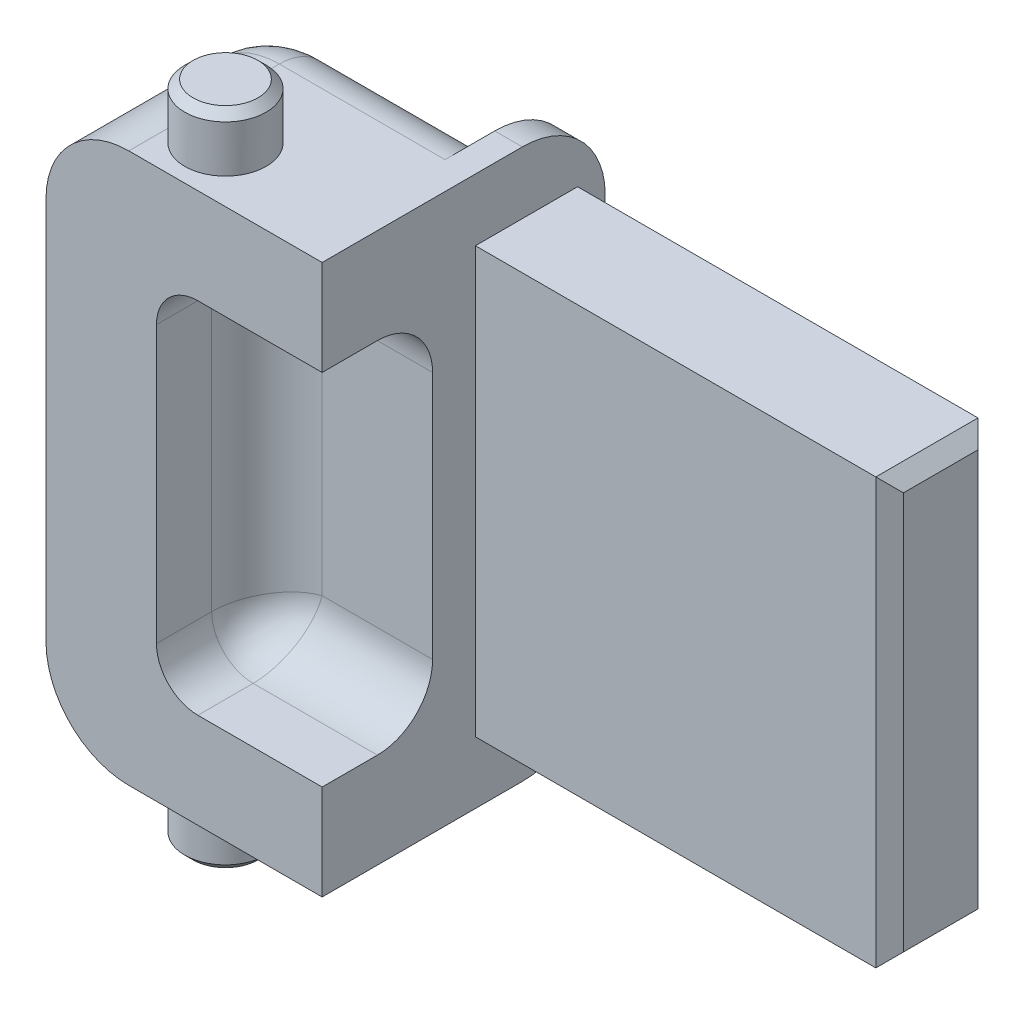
ISO-10303-21;
HEADER;
FILE_DESCRIPTION(('STEP AP214'),'2;1');
FILE_NAME('part.step','',(''),(''),'','','');
FILE_SCHEMA(('AUTOMOTIVE_DESIGN { 1 0 10303 214 1 1 1 1 }'));
ENDSEC;
DATA;
#1=APPLICATION_CONTEXT('core data for automotive mechanical design processes');
#2=APPLICATION_PROTOCOL_DEFINITION('international standard','automotive_design',2000,#1);
#3=PRODUCT_CONTEXT('',#1,'mechanical');
#4=PRODUCT('Part','Part','',(#3));
#5=PRODUCT_RELATED_PRODUCT_CATEGORY('part','',(#4));
#6=PRODUCT_DEFINITION_FORMATION('','',#4);
#7=PRODUCT_DEFINITION_CONTEXT('part definition',#1,'design');
#8=PRODUCT_DEFINITION('design','',#6,#7);
#9=PRODUCT_DEFINITION_SHAPE('','',#8);
#10=(LENGTH_UNIT() NAMED_UNIT(*) SI_UNIT(.MILLI.,.METRE.));
#11=(NAMED_UNIT(*) PLANE_ANGLE_UNIT() SI_UNIT($,.RADIAN.));
#12=(NAMED_UNIT(*) SI_UNIT($,.STERADIAN.) SOLID_ANGLE_UNIT());
#13=UNCERTAINTY_MEASURE_WITH_UNIT(LENGTH_MEASURE(1.E-05),#10,'distance_accuracy_value','');
#14=(GEOMETRIC_REPRESENTATION_CONTEXT(3) GLOBAL_UNCERTAINTY_ASSIGNED_CONTEXT((#13)) GLOBAL_UNIT_ASSIGNED_CONTEXT((#10,
#11,#12)) REPRESENTATION_CONTEXT('',''));
#15=CARTESIAN_POINT('',(0.,0.,0.));
#16=DIRECTION('',(0.,0.,1.));
#17=DIRECTION('',(1.,0.,0.));
#18=AXIS2_PLACEMENT_3D('',#15,#16,#17);
#19=CARTESIAN_POINT('',(10.,0.,7.45));
#20=DIRECTION('',(-1.,0.,0.));
#21=DIRECTION('',(0.,0.,1.));
#22=AXIS2_PLACEMENT_3D('',#19,#20,#21);
#23=PLANE('',#22);
#24=DIRECTION('',(0.,-1.,0.));
#25=VECTOR('',#24,1.);
#26=CARTESIAN_POINT('',(10.,22.1682979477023,-2.8));
#27=LINE('',#26,#25);
#28=CARTESIAN_POINT('',(10.,16.9,-2.8));
#29=VERTEX_POINT('',#28);
#30=CARTESIAN_POINT('',(10.,3.,-2.8));
#31=VERTEX_POINT('',#30);
#32=EDGE_CURVE('E243',#29,#31,#27,.T.);
#33=ORIENTED_EDGE('',*,*,#32,.F.);
#34=CARTESIAN_POINT('',(10.,16.9,0.2));
#35=DIRECTION('',(-1.,0.,0.));
#36=DIRECTION('',(0.,0.,1.));
#37=AXIS2_PLACEMENT_3D('',#34,#35,#36);
#38=CIRCLE('',#37,3.);
#39=CARTESIAN_POINT('',(10.,19.9,0.200000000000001));
#40=VERTEX_POINT('',#39);
#41=EDGE_CURVE('E423',#29,#40,#38,.F.);
#42=ORIENTED_EDGE('',*,*,#41,.T.);
#43=DIRECTION('',(0.,0.,-1.));
#44=VECTOR('',#43,1.);
#45=CARTESIAN_POINT('',(10.,19.9,7.45));
#46=LINE('',#45,#44);
#47=CARTESIAN_POINT('',(10.,19.9,7.45));
#48=VERTEX_POINT('',#47);
#49=EDGE_CURVE('E311',#48,#40,#46,.T.);
#50=ORIENTED_EDGE('',*,*,#49,.F.);
#51=DIRECTION('',(0.,1.,0.));
#52=VECTOR('',#51,1.);
#53=CARTESIAN_POINT('',(10.,0.,7.45));
#54=LINE('',#53,#52);
#55=CARTESIAN_POINT('',(10.,16.45,7.45));
#56=VERTEX_POINT('',#55);
#57=EDGE_CURVE('E282',#56,#48,#54,.T.);
#58=ORIENTED_EDGE('',*,*,#57,.F.);
#59=DIRECTION('',(0.,0.,-1.));
#60=VECTOR('',#59,1.);
#61=CARTESIAN_POINT('',(10.,16.45,7.45));
#62=LINE('',#61,#60);
#63=CARTESIAN_POINT('',(10.,16.45,5.45));
#64=VERTEX_POINT('',#63);
#65=EDGE_CURVE('E272',#56,#64,#62,.T.);
#66=ORIENTED_EDGE('',*,*,#65,.T.);
#67=CARTESIAN_POINT('',(10.,14.45,5.45));
#68=DIRECTION('',(-1.,0.,0.));
#69=DIRECTION('',(0.,0.,1.));
#70=AXIS2_PLACEMENT_3D('',#67,#68,#69);
#71=CIRCLE('',#70,2.);
#72=CARTESIAN_POINT('',(10.,14.45,3.45));
#73=VERTEX_POINT('',#72);
#74=EDGE_CURVE('E337',#64,#73,#71,.T.);
#75=ORIENTED_EDGE('',*,*,#74,.T.);
#76=DIRECTION('',(0.,1.,0.));
#77=VECTOR('',#76,1.);
#78=CARTESIAN_POINT('',(10.,0.,3.45));
#79=LINE('',#78,#77);
#80=CARTESIAN_POINT('',(10.,5.45,3.45));
#81=VERTEX_POINT('',#80);
#82=EDGE_CURVE('E317',#81,#73,#79,.T.);
#83=ORIENTED_EDGE('',*,*,#82,.F.);
#84=CARTESIAN_POINT('',(10.,5.45,5.45));
#85=DIRECTION('',(-1.,0.,0.));
#86=DIRECTION('',(0.,0.,1.));
#87=AXIS2_PLACEMENT_3D('',#84,#85,#86);
#88=CIRCLE('',#87,2.);
#89=CARTESIAN_POINT('',(10.,3.45,5.45));
#90=VERTEX_POINT('',#89);
#91=EDGE_CURVE('E339',#81,#90,#88,.T.);
#92=ORIENTED_EDGE('',*,*,#91,.T.);
#93=DIRECTION('',(0.,0.,1.));
#94=VECTOR('',#93,1.);
#95=CARTESIAN_POINT('',(10.,3.45,7.45));
#96=LINE('',#95,#94);
#97=CARTESIAN_POINT('',(10.,3.45,7.45));
#98=VERTEX_POINT('',#97);
#99=EDGE_CURVE('E280',#90,#98,#96,.T.);
#100=ORIENTED_EDGE('',*,*,#99,.T.);
#101=CARTESIAN_POINT('',(10.,0.,7.45));
#102=VERTEX_POINT('',#101);
#103=EDGE_CURVE('E283',#102,#98,#54,.T.);
#104=ORIENTED_EDGE('',*,*,#103,.F.);
#105=DIRECTION('',(0.,0.,-1.));
#106=VECTOR('',#105,1.);
#107=CARTESIAN_POINT('',(10.,0.,7.45));
#108=LINE('',#107,#106);
#109=CARTESIAN_POINT('',(10.,0.,0.200000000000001));
#110=VERTEX_POINT('',#109);
#111=EDGE_CURVE('E296',#102,#110,#108,.T.);
#112=ORIENTED_EDGE('',*,*,#111,.T.);
#113=CARTESIAN_POINT('',(10.,3.,0.2));
#114=DIRECTION('',(-1.,0.,0.));
#115=DIRECTION('',(0.,0.,1.));
#116=AXIS2_PLACEMENT_3D('',#113,#114,#115);
#117=CIRCLE('',#116,3.);
#118=EDGE_CURVE('E421',#110,#31,#117,.F.);
#119=ORIENTED_EDGE('',*,*,#118,.T.);
#120=EDGE_LOOP('',(#33,#42,#50,#58,#66,#75,#83,#92,#100,#104,#112,#119));
#121=FACE_BOUND('',#120,.T.);
#122=DIRECTION('',(0.,-1.,0.));
#123=VECTOR('',#122,1.);
#124=CARTESIAN_POINT('',(10.,17.65,1.9));
#125=LINE('',#124,#123);
#126=CARTESIAN_POINT('',(10.,17.65,1.9));
#127=VERTEX_POINT('',#126);
#128=CARTESIAN_POINT('',(10.,2.25,1.9));
#129=VERTEX_POINT('',#128);
#130=EDGE_CURVE('E214',#127,#129,#125,.T.);
#131=ORIENTED_EDGE('',*,*,#130,.F.);
#132=DIRECTION('',(0.,0.,1.));
#133=VECTOR('',#132,1.);
#134=CARTESIAN_POINT('',(10.,17.65,1.9));
#135=LINE('',#134,#133);
#136=CARTESIAN_POINT('',(10.,17.65,-1.8));
#137=VERTEX_POINT('',#136);
#138=EDGE_CURVE('E217',#137,#127,#135,.T.);
#139=ORIENTED_EDGE('',*,*,#138,.F.);
#140=DIRECTION('',(0.,1.,0.));
#141=VECTOR('',#140,1.);
#142=CARTESIAN_POINT('',(10.,17.65,-1.8));
#143=LINE('',#142,#141);
#144=CARTESIAN_POINT('',(10.,2.25,-1.8));
#145=VERTEX_POINT('',#144);
#146=EDGE_CURVE('E228',#145,#137,#143,.T.);
#147=ORIENTED_EDGE('',*,*,#146,.F.);
#148=DIRECTION('',(0.,0.,-1.));
#149=VECTOR('',#148,1.);
#150=CARTESIAN_POINT('',(10.,2.25,1.9));
#151=LINE('',#150,#149);
#152=EDGE_CURVE('E225',#129,#145,#151,.T.);
#153=ORIENTED_EDGE('',*,*,#152,.F.);
#154=EDGE_LOOP('',(#131,#139,#147,#153));
#155=FACE_BOUND('',#154,.T.);
#156=ADVANCED_FACE('F33',(#121,#155),#23,.F.);
#157=CARTESIAN_POINT('',(9.00000000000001,22.1682979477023,-2.8));
#158=DIRECTION('',(1.,0.,0.));
#159=DIRECTION('',(0.,0.,-1.));
#160=AXIS2_PLACEMENT_3D('',#157,#158,#159);
#161=PLANE('',#160);
#162=DIRECTION('',(0.,0.,1.));
#163=VECTOR('',#162,1.);
#164=CARTESIAN_POINT('',(9.00000000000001,19.9,-2.8));
#165=LINE('',#164,#163);
#166=CARTESIAN_POINT('',(9.00000000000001,19.9,0.2));
#167=VERTEX_POINT('',#166);
#168=CARTESIAN_POINT('',(9.00000000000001,19.9,2.));
#169=VERTEX_POINT('',#168);
#170=EDGE_CURVE('E238',#167,#169,#165,.T.);
#171=ORIENTED_EDGE('',*,*,#170,.F.);
#172=CARTESIAN_POINT('',(9.00000000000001,16.9,0.2));
#173=DIRECTION('',(1.,0.,0.));
#174=DIRECTION('',(0.,0.,-1.));
#175=AXIS2_PLACEMENT_3D('',#172,#173,#174);
#176=CIRCLE('',#175,3.);
#177=CARTESIAN_POINT('',(9.00000000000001,16.9,-2.8));
#178=VERTEX_POINT('',#177);
#179=EDGE_CURVE('E429',#167,#178,#176,.F.);
#180=ORIENTED_EDGE('',*,*,#179,.T.);
#181=DIRECTION('',(0.,1.,0.));
#182=VECTOR('',#181,1.);
#183=CARTESIAN_POINT('',(9.00000000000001,22.1682979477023,-2.8));
#184=LINE('',#183,#182);
#185=CARTESIAN_POINT('',(9.00000000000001,3.,-2.8));
#186=VERTEX_POINT('',#185);
#187=EDGE_CURVE('E246',#186,#178,#184,.T.);
#188=ORIENTED_EDGE('',*,*,#187,.F.);
#189=CARTESIAN_POINT('',(9.00000000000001,3.,0.2));
#190=DIRECTION('',(1.,0.,0.));
#191=DIRECTION('',(0.,0.,-1.));
#192=AXIS2_PLACEMENT_3D('',#189,#190,#191);
#193=CIRCLE('',#192,3.);
#194=CARTESIAN_POINT('',(9.00000000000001,0.,0.2));
#195=VERTEX_POINT('',#194);
#196=EDGE_CURVE('E427',#186,#195,#193,.F.);
#197=ORIENTED_EDGE('',*,*,#196,.T.);
#198=DIRECTION('',(0.,0.,-1.));
#199=VECTOR('',#198,1.);
#200=CARTESIAN_POINT('',(9.00000000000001,0.,-2.8));
#201=LINE('',#200,#199);
#202=CARTESIAN_POINT('',(9.00000000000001,0.,2.));
#203=VERTEX_POINT('',#202);
#204=EDGE_CURVE('E240',#203,#195,#201,.T.);
#205=ORIENTED_EDGE('',*,*,#204,.F.);
#206=CARTESIAN_POINT('',(9.00000000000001,2.,2.));
#207=DIRECTION('',(1.,0.,0.));
#208=DIRECTION('',(0.,0.,-1.));
#209=AXIS2_PLACEMENT_3D('',#206,#207,#208);
#210=CIRCLE('',#209,2.);
#211=CARTESIAN_POINT('',(9.00000000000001,2.,0.));
#212=VERTEX_POINT('',#211);
#213=EDGE_CURVE('E252',#212,#203,#210,.F.);
#214=ORIENTED_EDGE('',*,*,#213,.F.);
#215=DIRECTION('',(0.,-1.,0.));
#216=VECTOR('',#215,1.);
#217=CARTESIAN_POINT('',(9.00000000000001,16.9,0.));
#218=LINE('',#217,#216);
#219=CARTESIAN_POINT('',(9.00000000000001,17.9,0.));
#220=VERTEX_POINT('',#219);
#221=EDGE_CURVE('E249',#220,#212,#218,.T.);
#222=ORIENTED_EDGE('',*,*,#221,.F.);
#223=CARTESIAN_POINT('',(9.00000000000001,17.9,2.));
#224=DIRECTION('',(1.,0.,0.));
#225=DIRECTION('',(0.,0.,-1.));
#226=AXIS2_PLACEMENT_3D('',#223,#224,#225);
#227=CIRCLE('',#226,2.);
#228=EDGE_CURVE('E402',#169,#220,#227,.F.);
#229=ORIENTED_EDGE('',*,*,#228,.F.);
#230=EDGE_LOOP('',(#171,#180,#188,#197,#205,#214,#222,#229));
#231=FACE_BOUND('',#230,.T.);
#232=ADVANCED_FACE('F503',(#231),#161,.F.);
#233=CARTESIAN_POINT('',(0.,0.,-2.8));
#234=DIRECTION('',(0.,0.,-1.));
#235=DIRECTION('',(-1.,0.,0.));
#236=AXIS2_PLACEMENT_3D('',#233,#234,#235);
#237=PLANE('',#236);
#238=ORIENTED_EDGE('',*,*,#187,.T.);
#239=DIRECTION('',(1.,0.,0.));
#240=VECTOR('',#239,1.);
#241=CARTESIAN_POINT('',(10.,16.9,-2.8));
#242=LINE('',#241,#240);
#243=EDGE_CURVE('E418',#178,#29,#242,.T.);
#244=ORIENTED_EDGE('',*,*,#243,.T.);
#245=ORIENTED_EDGE('',*,*,#32,.T.);
#246=DIRECTION('',(-1.,0.,0.));
#247=VECTOR('',#246,1.);
#248=CARTESIAN_POINT('',(9.00000000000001,3.,-2.8));
#249=LINE('',#248,#247);
#250=EDGE_CURVE('E415',#31,#186,#249,.T.);
#251=ORIENTED_EDGE('',*,*,#250,.T.);
#252=EDGE_LOOP('',(#238,#244,#245,#251));
#253=FACE_BOUND('',#252,.T.);
#254=ADVANCED_FACE('F510',(#253),#237,.T.);
#255=CARTESIAN_POINT('',(3.00000000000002,19.9,7.45));
#256=DIRECTION('',(0.,-1.,0.));
#257=DIRECTION('',(0.,0.,-1.));
#258=AXIS2_PLACEMENT_3D('',#255,#256,#257);
#259=PLANE('',#258);
#260=CARTESIAN_POINT('',(4.5,19.9,5.45));
#261=DIRECTION('',(0.,-1.,0.));
#262=DIRECTION('',(0.,0.,-1.));
#263=AXIS2_PLACEMENT_3D('',#260,#261,#262);
#264=CIRCLE('',#263,1.475);
#265=CARTESIAN_POINT('',(4.5,19.9,3.975));
#266=VERTEX_POINT('',#265);
#267=EDGE_CURVE('E436',#266,#266,#264,.F.);
#268=ORIENTED_EDGE('',*,*,#267,.F.);
#269=EDGE_LOOP('',(#268));
#270=FACE_BOUND('',#269,.T.);
#271=ORIENTED_EDGE('',*,*,#49,.T.);
#272=DIRECTION('',(1.,0.,0.));
#273=VECTOR('',#272,1.);
#274=CARTESIAN_POINT('',(9.00000000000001,19.9,0.2));
#275=LINE('',#274,#273);
#276=EDGE_CURVE('E425',#40,#167,#275,.F.);
#277=ORIENTED_EDGE('',*,*,#276,.T.);
#278=ORIENTED_EDGE('',*,*,#170,.T.);
#279=DIRECTION('',(-1.,0.,0.));
#280=VECTOR('',#279,1.);
#281=CARTESIAN_POINT('',(3.00000000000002,19.9,2.));
#282=LINE('',#281,#280);
#283=CARTESIAN_POINT('',(3.00000000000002,19.9,2.));
#284=VERTEX_POINT('',#283);
#285=EDGE_CURVE('E341',#169,#284,#282,.T.);
#286=ORIENTED_EDGE('',*,*,#285,.T.);
#287=DIRECTION('',(0.,0.,-1.));
#288=VECTOR('',#287,1.);
#289=CARTESIAN_POINT('',(3.00000000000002,19.9,7.45));
#290=LINE('',#289,#288);
#291=CARTESIAN_POINT('',(3.00000000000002,19.9,7.45));
#292=VERTEX_POINT('',#291);
#293=EDGE_CURVE('E308',#292,#284,#290,.T.);
#294=ORIENTED_EDGE('',*,*,#293,.F.);
#295=DIRECTION('',(-1.,0.,0.));
#296=VECTOR('',#295,1.);
#297=CARTESIAN_POINT('',(3.00000000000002,19.9,7.45));
#298=LINE('',#297,#296);
#299=EDGE_CURVE('E286',#48,#292,#298,.T.);
#300=ORIENTED_EDGE('',*,*,#299,.F.);
#301=EDGE_LOOP('',(#271,#277,#278,#286,#294,#300));
#302=FACE_BOUND('',#301,.T.);
#303=ADVANCED_FACE('F515',(#270,#302),#259,.F.);
#304=CARTESIAN_POINT('',(3.00000000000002,0.,7.45));
#305=DIRECTION('',(0.,1.,0.));
#306=DIRECTION('',(0.,0.,1.));
#307=AXIS2_PLACEMENT_3D('',#304,#305,#306);
#308=PLANE('',#307);
#309=CARTESIAN_POINT('',(4.5,0.,5.45));
#310=DIRECTION('',(0.,1.,0.));
#311=DIRECTION('',(0.,0.,1.));
#312=AXIS2_PLACEMENT_3D('',#309,#310,#311);
#313=CIRCLE('',#312,1.475);
#314=CARTESIAN_POINT('',(4.5,0.,6.925));
#315=VERTEX_POINT('',#314);
#316=EDGE_CURVE('E433',#315,#315,#313,.F.);
#317=ORIENTED_EDGE('',*,*,#316,.F.);
#318=EDGE_LOOP('',(#317));
#319=FACE_BOUND('',#318,.T.);
#320=ORIENTED_EDGE('',*,*,#204,.T.);
#321=DIRECTION('',(-1.,0.,0.));
#322=VECTOR('',#321,1.);
#323=CARTESIAN_POINT('',(10.,0.,0.2));
#324=LINE('',#323,#322);
#325=EDGE_CURVE('E431',#195,#110,#324,.F.);
#326=ORIENTED_EDGE('',*,*,#325,.T.);
#327=ORIENTED_EDGE('',*,*,#111,.F.);
#328=DIRECTION('',(1.,0.,0.));
#329=VECTOR('',#328,1.);
#330=CARTESIAN_POINT('',(3.00000000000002,0.,7.45));
#331=LINE('',#330,#329);
#332=CARTESIAN_POINT('',(3.00000000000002,0.,7.45));
#333=VERTEX_POINT('',#332);
#334=EDGE_CURVE('E294',#333,#102,#331,.T.);
#335=ORIENTED_EDGE('',*,*,#334,.F.);
#336=DIRECTION('',(0.,0.,-1.));
#337=VECTOR('',#336,1.);
#338=CARTESIAN_POINT('',(3.00000000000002,0.,7.45));
#339=LINE('',#338,#337);
#340=CARTESIAN_POINT('',(3.00000000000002,0.,2.));
#341=VERTEX_POINT('',#340);
#342=EDGE_CURVE('E299',#333,#341,#339,.T.);
#343=ORIENTED_EDGE('',*,*,#342,.T.);
#344=DIRECTION('',(1.,0.,0.));
#345=VECTOR('',#344,1.);
#346=CARTESIAN_POINT('',(10.,0.,2.));
#347=LINE('',#346,#345);
#348=EDGE_CURVE('E399',#341,#203,#347,.T.);
#349=ORIENTED_EDGE('',*,*,#348,.T.);
#350=EDGE_LOOP('',(#320,#326,#327,#335,#343,#349));
#351=FACE_BOUND('',#350,.T.);
#352=ADVANCED_FACE('F518',(#319,#351),#308,.F.);
#353=CARTESIAN_POINT('',(3.,16.9,0.));
#354=DIRECTION('',(0.,0.,-1.));
#355=DIRECTION('',(-1.,0.,0.));
#356=AXIS2_PLACEMENT_3D('',#353,#354,#355);
#357=PLANE('',#356);
#358=DIRECTION('',(-1.,0.,0.));
#359=VECTOR('',#358,1.);
#360=CARTESIAN_POINT('',(10.,17.9,0.));
#361=LINE('',#360,#359);
#362=CARTESIAN_POINT('',(3.00000000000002,17.9,0.));
#363=VERTEX_POINT('',#362);
#364=EDGE_CURVE('E390',#363,#220,#361,.F.);
#365=ORIENTED_EDGE('',*,*,#364,.T.);
#366=ORIENTED_EDGE('',*,*,#221,.T.);
#367=DIRECTION('',(1.,0.,0.));
#368=VECTOR('',#367,1.);
#369=CARTESIAN_POINT('',(3.00000000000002,2.,0.));
#370=LINE('',#369,#368);
#371=CARTESIAN_POINT('',(3.00000000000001,2.,0.));
#372=VERTEX_POINT('',#371);
#373=EDGE_CURVE('E382',#212,#372,#370,.F.);
#374=ORIENTED_EDGE('',*,*,#373,.T.);
#375=CARTESIAN_POINT('',(3.,3.,0.));
#376=DIRECTION('',(0.,0.,-1.));
#377=DIRECTION('',(-1.,0.,0.));
#378=AXIS2_PLACEMENT_3D('',#375,#376,#377);
#379=CIRCLE('',#378,1.);
#380=CARTESIAN_POINT('',(2.,3.00000000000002,0.));
#381=VERTEX_POINT('',#380);
#382=EDGE_CURVE('E384',#372,#381,#379,.T.);
#383=ORIENTED_EDGE('',*,*,#382,.T.);
#384=DIRECTION('',(0.,-1.,0.));
#385=VECTOR('',#384,1.);
#386=CARTESIAN_POINT('',(2.,16.9,0.));
#387=LINE('',#386,#385);
#388=CARTESIAN_POINT('',(2.,16.9,0.));
#389=VERTEX_POINT('',#388);
#390=EDGE_CURVE('E386',#381,#389,#387,.F.);
#391=ORIENTED_EDGE('',*,*,#390,.T.);
#392=CARTESIAN_POINT('',(3.,16.9,0.));
#393=DIRECTION('',(0.,0.,-1.));
#394=DIRECTION('',(-1.,0.,0.));
#395=AXIS2_PLACEMENT_3D('',#392,#393,#394);
#396=CIRCLE('',#395,1.);
#397=EDGE_CURVE('E388',#389,#363,#396,.T.);
#398=ORIENTED_EDGE('',*,*,#397,.T.);
#399=EDGE_LOOP('',(#365,#366,#374,#383,#391,#398));
#400=FACE_BOUND('',#399,.T.);
#401=ADVANCED_FACE('F536',(#400),#357,.T.);
#402=CARTESIAN_POINT('',(3.00000000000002,2.,2.));
#403=DIRECTION('',(-1.,0.,0.));
#404=DIRECTION('',(0.,0.,1.));
#405=AXIS2_PLACEMENT_3D('',#402,#403,#404);
#406=CYLINDRICAL_SURFACE('',#405,2.);
#407=ORIENTED_EDGE('',*,*,#373,.F.);
#408=ORIENTED_EDGE('',*,*,#213,.T.);
#409=ORIENTED_EDGE('',*,*,#348,.F.);
#410=CARTESIAN_POINT('',(3.00000000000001,2.,2.));
#411=DIRECTION('',(-1.,0.,0.));
#412=DIRECTION('',(0.,-1.,0.));
#413=AXIS2_PLACEMENT_3D('',#410,#411,#412);
#414=CIRCLE('',#413,2.);
#415=EDGE_CURVE('E345',#372,#341,#414,.T.);
#416=ORIENTED_EDGE('',*,*,#415,.F.);
#417=EDGE_LOOP('',(#407,#408,#409,#416));
#418=FACE_BOUND('',#417,.T.);
#419=ADVANCED_FACE('F540',(#418),#406,.T.);
#420=CARTESIAN_POINT('',(3.00000000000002,17.9,2.));
#421=DIRECTION('',(1.,0.,0.));
#422=DIRECTION('',(0.,0.,-1.));
#423=AXIS2_PLACEMENT_3D('',#420,#421,#422);
#424=CYLINDRICAL_SURFACE('',#423,2.);
#425=ORIENTED_EDGE('',*,*,#285,.F.);
#426=ORIENTED_EDGE('',*,*,#228,.T.);
#427=ORIENTED_EDGE('',*,*,#364,.F.);
#428=CARTESIAN_POINT('',(3.00000000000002,17.9,2.));
#429=DIRECTION('',(1.,0.,0.));
#430=DIRECTION('',(0.,0.,-1.));
#431=AXIS2_PLACEMENT_3D('',#428,#429,#430);
#432=CIRCLE('',#431,2.);
#433=EDGE_CURVE('E255',#363,#284,#432,.T.);
#434=ORIENTED_EDGE('',*,*,#433,.T.);
#435=EDGE_LOOP('',(#425,#426,#427,#434));
#436=FACE_BOUND('',#435,.T.);
#437=ADVANCED_FACE('F524',(#436),#424,.T.);
#438=CARTESIAN_POINT('',(3.,16.9,7.45));
#439=DIRECTION('',(0.,0.,-1.));
#440=DIRECTION('',(-1.,0.,0.));
#441=AXIS2_PLACEMENT_3D('',#438,#439,#440);
#442=CYLINDRICAL_SURFACE('',#441,3.);
#443=ORIENTED_EDGE('',*,*,#293,.T.);
#444=CARTESIAN_POINT('',(3.,16.9,2.));
#445=DIRECTION('',(0.,0.,-1.));
#446=DIRECTION('',(-1.,0.,0.));
#447=AXIS2_PLACEMENT_3D('',#444,#445,#446);
#448=CIRCLE('',#447,3.);
#449=CARTESIAN_POINT('',(0.,16.9,2.));
#450=VERTEX_POINT('',#449);
#451=EDGE_CURVE('E393',#284,#450,#448,.F.);
#452=ORIENTED_EDGE('',*,*,#451,.T.);
#453=DIRECTION('',(0.,0.,-1.));
#454=VECTOR('',#453,1.);
#455=CARTESIAN_POINT('',(0.,16.9,7.45));
#456=LINE('',#455,#454);
#457=CARTESIAN_POINT('',(0.,16.9,7.45));
#458=VERTEX_POINT('',#457);
#459=EDGE_CURVE('E305',#458,#450,#456,.T.);
#460=ORIENTED_EDGE('',*,*,#459,.F.);
#461=CARTESIAN_POINT('',(3.,16.9,7.45));
#462=DIRECTION('',(0.,0.,1.));
#463=DIRECTION('',(-1.,0.,0.));
#464=AXIS2_PLACEMENT_3D('',#461,#462,#463);
#465=CIRCLE('',#464,3.);
#466=EDGE_CURVE('E288',#292,#458,#465,.T.);
#467=ORIENTED_EDGE('',*,*,#466,.F.);
#468=EDGE_LOOP('',(#443,#452,#460,#467));
#469=FACE_BOUND('',#468,.T.);
#470=ADVANCED_FACE('F520',(#469),#442,.T.);
#471=CARTESIAN_POINT('',(0.,3.00000000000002,7.45));
#472=DIRECTION('',(1.,0.,0.));
#473=DIRECTION('',(0.,0.,-1.));
#474=AXIS2_PLACEMENT_3D('',#471,#472,#473);
#475=PLANE('',#474);
#476=ORIENTED_EDGE('',*,*,#459,.T.);
#477=DIRECTION('',(0.,-1.,0.));
#478=VECTOR('',#477,1.);
#479=CARTESIAN_POINT('',(0.,3.00000000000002,2.));
#480=LINE('',#479,#478);
#481=CARTESIAN_POINT('',(0.,3.00000000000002,2.));
#482=VERTEX_POINT('',#481);
#483=EDGE_CURVE('E395',#450,#482,#480,.T.);
#484=ORIENTED_EDGE('',*,*,#483,.T.);
#485=DIRECTION('',(0.,0.,-1.));
#486=VECTOR('',#485,1.);
#487=CARTESIAN_POINT('',(0.,3.00000000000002,7.45));
#488=LINE('',#487,#486);
#489=CARTESIAN_POINT('',(0.,3.00000000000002,7.45));
#490=VERTEX_POINT('',#489);
#491=EDGE_CURVE('E302',#490,#482,#488,.T.);
#492=ORIENTED_EDGE('',*,*,#491,.F.);
#493=DIRECTION('',(0.,-1.,0.));
#494=VECTOR('',#493,1.);
#495=CARTESIAN_POINT('',(0.,3.00000000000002,7.45));
#496=LINE('',#495,#494);
#497=EDGE_CURVE('E290',#458,#490,#496,.T.);
#498=ORIENTED_EDGE('',*,*,#497,.F.);
#499=EDGE_LOOP('',(#476,#484,#492,#498));
#500=FACE_BOUND('',#499,.T.);
#501=ADVANCED_FACE('F523',(#500),#475,.F.);
#502=CARTESIAN_POINT('',(3.,3.,7.45));
#503=DIRECTION('',(0.,0.,-1.));
#504=DIRECTION('',(-1.,0.,0.));
#505=AXIS2_PLACEMENT_3D('',#502,#503,#504);
#506=CYLINDRICAL_SURFACE('',#505,3.);
#507=ORIENTED_EDGE('',*,*,#491,.T.);
#508=CARTESIAN_POINT('',(3.,3.,2.));
#509=DIRECTION('',(0.,0.,-1.));
#510=DIRECTION('',(-1.,0.,0.));
#511=AXIS2_PLACEMENT_3D('',#508,#509,#510);
#512=CIRCLE('',#511,3.);
#513=EDGE_CURVE('E397',#482,#341,#512,.F.);
#514=ORIENTED_EDGE('',*,*,#513,.T.);
#515=ORIENTED_EDGE('',*,*,#342,.F.);
#516=CARTESIAN_POINT('',(3.,3.,7.45));
#517=DIRECTION('',(0.,0.,1.));
#518=DIRECTION('',(-1.,0.,0.));
#519=AXIS2_PLACEMENT_3D('',#516,#517,#518);
#520=CIRCLE('',#519,3.);
#521=EDGE_CURVE('E292',#490,#333,#520,.T.);
#522=ORIENTED_EDGE('',*,*,#521,.F.);
#523=EDGE_LOOP('',(#507,#514,#515,#522));
#524=FACE_BOUND('',#523,.T.);
#525=ADVANCED_FACE('F528',(#524),#506,.T.);
#526=CARTESIAN_POINT('',(3.,16.9,7.45));
#527=DIRECTION('',(0.,0.,-1.));
#528=DIRECTION('',(-1.,0.,0.));
#529=AXIS2_PLACEMENT_3D('',#526,#527,#528);
#530=PLANE('',#529);
#531=ORIENTED_EDGE('',*,*,#103,.T.);
#532=DIRECTION('',(1.,0.,0.));
#533=VECTOR('',#532,1.);
#534=CARTESIAN_POINT('',(5.50000000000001,3.45,7.45));
#535=LINE('',#534,#533);
#536=CARTESIAN_POINT('',(5.50000000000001,3.45,7.45));
#537=VERTEX_POINT('',#536);
#538=EDGE_CURVE('E266',#537,#98,#535,.T.);
#539=ORIENTED_EDGE('',*,*,#538,.F.);
#540=CARTESIAN_POINT('',(5.5,4.95,7.45));
#541=DIRECTION('',(0.,0.,1.));
#542=DIRECTION('',(1.,0.,0.));
#543=AXIS2_PLACEMENT_3D('',#540,#541,#542);
#544=CIRCLE('',#543,1.5);
#545=CARTESIAN_POINT('',(4.,4.95000000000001,7.45));
#546=VERTEX_POINT('',#545);
#547=EDGE_CURVE('E263',#546,#537,#544,.T.);
#548=ORIENTED_EDGE('',*,*,#547,.F.);
#549=DIRECTION('',(0.,-1.,0.));
#550=VECTOR('',#549,1.);
#551=CARTESIAN_POINT('',(4.,14.95,7.45));
#552=LINE('',#551,#550);
#553=CARTESIAN_POINT('',(4.,14.95,7.45));
#554=VERTEX_POINT('',#553);
#555=EDGE_CURVE('E259',#554,#546,#552,.T.);
#556=ORIENTED_EDGE('',*,*,#555,.F.);
#557=CARTESIAN_POINT('',(5.5,14.95,7.45));
#558=DIRECTION('',(0.,0.,1.));
#559=DIRECTION('',(-1.,0.,0.));
#560=AXIS2_PLACEMENT_3D('',#557,#558,#559);
#561=CIRCLE('',#560,1.5);
#562=CARTESIAN_POINT('',(5.50000000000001,16.45,7.45));
#563=VERTEX_POINT('',#562);
#564=EDGE_CURVE('E256',#563,#554,#561,.T.);
#565=ORIENTED_EDGE('',*,*,#564,.F.);
#566=DIRECTION('',(1.,0.,0.));
#567=VECTOR('',#566,1.);
#568=CARTESIAN_POINT('',(3.,16.45,7.45));
#569=LINE('',#568,#567);
#570=EDGE_CURVE('E314',#563,#56,#569,.T.);
#571=ORIENTED_EDGE('',*,*,#570,.T.);
#572=ORIENTED_EDGE('',*,*,#57,.T.);
#573=ORIENTED_EDGE('',*,*,#299,.T.);
#574=ORIENTED_EDGE('',*,*,#466,.T.);
#575=ORIENTED_EDGE('',*,*,#497,.T.);
#576=ORIENTED_EDGE('',*,*,#521,.T.);
#577=ORIENTED_EDGE('',*,*,#334,.T.);
#578=EDGE_LOOP('',(#531,#539,#548,#556,#565,#571,#572,#573,#574,#575,#576,#577));
#579=FACE_BOUND('',#578,.T.);
#580=ADVANCED_FACE('F532',(#579),#530,.F.);
#581=CARTESIAN_POINT('',(5.5,4.95,3.45));
#582=DIRECTION('',(0.,0.,1.));
#583=DIRECTION('',(1.,0.,0.));
#584=AXIS2_PLACEMENT_3D('',#581,#582,#583);
#585=PLANE('',#584);
#586=ORIENTED_EDGE('',*,*,#82,.T.);
#587=DIRECTION('',(-1.,0.,0.));
#588=VECTOR('',#587,1.);
#589=CARTESIAN_POINT('',(5.5,14.45,3.45));
#590=LINE('',#589,#588);
#591=CARTESIAN_POINT('',(6.,14.45,3.45));
#592=VERTEX_POINT('',#591);
#593=EDGE_CURVE('E324',#73,#592,#590,.T.);
#594=ORIENTED_EDGE('',*,*,#593,.T.);
#595=DIRECTION('',(0.,-1.,0.));
#596=VECTOR('',#595,1.);
#597=CARTESIAN_POINT('',(6.,4.95,3.45));
#598=LINE('',#597,#596);
#599=CARTESIAN_POINT('',(6.,5.45,3.45));
#600=VERTEX_POINT('',#599);
#601=EDGE_CURVE('E320',#592,#600,#598,.T.);
#602=ORIENTED_EDGE('',*,*,#601,.T.);
#603=DIRECTION('',(1.,0.,0.));
#604=VECTOR('',#603,1.);
#605=CARTESIAN_POINT('',(5.5,5.45,3.45));
#606=LINE('',#605,#604);
#607=EDGE_CURVE('E322',#600,#81,#606,.T.);
#608=ORIENTED_EDGE('',*,*,#607,.T.);
#609=EDGE_LOOP('',(#586,#594,#602,#608));
#610=FACE_BOUND('',#609,.T.);
#611=ADVANCED_FACE('F544',(#610),#585,.T.);
#612=CARTESIAN_POINT('',(5.50000000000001,3.45,3.45));
#613=DIRECTION('',(0.,-1.,0.));
#614=DIRECTION('',(0.,0.,-1.));
#615=AXIS2_PLACEMENT_3D('',#612,#613,#614);
#616=PLANE('',#615);
#617=ORIENTED_EDGE('',*,*,#99,.F.);
#618=DIRECTION('',(1.,0.,0.));
#619=VECTOR('',#618,1.);
#620=CARTESIAN_POINT('',(5.50000000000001,3.45,5.45));
#621=LINE('',#620,#619);
#622=CARTESIAN_POINT('',(5.50000000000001,3.45,5.45));
#623=VERTEX_POINT('',#622);
#624=EDGE_CURVE('E329',#90,#623,#621,.F.);
#625=ORIENTED_EDGE('',*,*,#624,.T.);
#626=DIRECTION('',(0.,0.,1.));
#627=VECTOR('',#626,1.);
#628=CARTESIAN_POINT('',(5.50000000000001,3.45,3.45));
#629=LINE('',#628,#627);
#630=EDGE_CURVE('E270',#623,#537,#629,.T.);
#631=ORIENTED_EDGE('',*,*,#630,.T.);
#632=ORIENTED_EDGE('',*,*,#538,.T.);
#633=EDGE_LOOP('',(#617,#625,#631,#632));
#634=FACE_BOUND('',#633,.T.);
#635=ADVANCED_FACE('F550',(#634),#616,.F.);
#636=CARTESIAN_POINT('',(5.50000000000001,16.45,3.45));
#637=DIRECTION('',(0.,1.,0.));
#638=DIRECTION('',(0.,0.,1.));
#639=AXIS2_PLACEMENT_3D('',#636,#637,#638);
#640=PLANE('',#639);
#641=DIRECTION('',(0.,0.,1.));
#642=VECTOR('',#641,1.);
#643=CARTESIAN_POINT('',(5.50000000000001,16.45,3.45));
#644=LINE('',#643,#642);
#645=CARTESIAN_POINT('',(5.50000000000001,16.45,5.45));
#646=VERTEX_POINT('',#645);
#647=EDGE_CURVE('E269',#646,#563,#644,.T.);
#648=ORIENTED_EDGE('',*,*,#647,.F.);
#649=DIRECTION('',(-1.,0.,0.));
#650=VECTOR('',#649,1.);
#651=CARTESIAN_POINT('',(5.50000000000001,16.45,5.45));
#652=LINE('',#651,#650);
#653=EDGE_CURVE('E327',#646,#64,#652,.F.);
#654=ORIENTED_EDGE('',*,*,#653,.T.);
#655=ORIENTED_EDGE('',*,*,#65,.F.);
#656=ORIENTED_EDGE('',*,*,#570,.F.);
#657=EDGE_LOOP('',(#648,#654,#655,#656));
#658=FACE_BOUND('',#657,.T.);
#659=ADVANCED_FACE('F546',(#658),#640,.F.);
#660=CARTESIAN_POINT('',(5.5,4.95,3.45));
#661=DIRECTION('',(0.,0.,1.));
#662=DIRECTION('',(1.,0.,0.));
#663=AXIS2_PLACEMENT_3D('',#660,#661,#662);
#664=CYLINDRICAL_SURFACE('',#663,1.5);
#665=ORIENTED_EDGE('',*,*,#630,.F.);
#666=CARTESIAN_POINT('',(5.5,4.95,5.45));
#667=DIRECTION('',(0.,0.,-1.));
#668=DIRECTION('',(-1.,0.,0.));
#669=AXIS2_PLACEMENT_3D('',#666,#667,#668);
#670=CIRCLE('',#669,1.5);
#671=CARTESIAN_POINT('',(4.,4.95000000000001,5.45));
#672=VERTEX_POINT('',#671);
#673=EDGE_CURVE('E331',#623,#672,#670,.T.);
#674=ORIENTED_EDGE('',*,*,#673,.T.);
#675=DIRECTION('',(0.,0.,1.));
#676=VECTOR('',#675,1.);
#677=CARTESIAN_POINT('',(4.,4.95000000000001,3.45));
#678=LINE('',#677,#676);
#679=EDGE_CURVE('E273',#672,#546,#678,.T.);
#680=ORIENTED_EDGE('',*,*,#679,.T.);
#681=ORIENTED_EDGE('',*,*,#547,.T.);
#682=EDGE_LOOP('',(#665,#674,#680,#681));
#683=FACE_BOUND('',#682,.T.);
#684=ADVANCED_FACE('F549',(#683),#664,.F.);
#685=CARTESIAN_POINT('',(4.,14.95,3.45));
#686=DIRECTION('',(-1.,0.,0.));
#687=DIRECTION('',(0.,-1.,0.));
#688=AXIS2_PLACEMENT_3D('',#685,#686,#687);
#689=PLANE('',#688);
#690=ORIENTED_EDGE('',*,*,#679,.F.);
#691=DIRECTION('',(0.,-1.,0.));
#692=VECTOR('',#691,1.);
#693=CARTESIAN_POINT('',(4.,14.95,5.45));
#694=LINE('',#693,#692);
#695=CARTESIAN_POINT('',(4.,14.95,5.45));
#696=VERTEX_POINT('',#695);
#697=EDGE_CURVE('E335',#672,#696,#694,.F.);
#698=ORIENTED_EDGE('',*,*,#697,.T.);
#699=DIRECTION('',(0.,0.,1.));
#700=VECTOR('',#699,1.);
#701=CARTESIAN_POINT('',(4.,14.95,3.45));
#702=LINE('',#701,#700);
#703=EDGE_CURVE('E275',#696,#554,#702,.T.);
#704=ORIENTED_EDGE('',*,*,#703,.T.);
#705=ORIENTED_EDGE('',*,*,#555,.T.);
#706=EDGE_LOOP('',(#690,#698,#704,#705));
#707=FACE_BOUND('',#706,.T.);
#708=ADVANCED_FACE('F555',(#707),#689,.F.);
#709=CARTESIAN_POINT('',(5.5,14.95,3.45));
#710=DIRECTION('',(0.,0.,1.));
#711=DIRECTION('',(1.,0.,0.));
#712=AXIS2_PLACEMENT_3D('',#709,#710,#711);
#713=CYLINDRICAL_SURFACE('',#712,1.5);
#714=ORIENTED_EDGE('',*,*,#703,.F.);
#715=CARTESIAN_POINT('',(5.5,14.95,5.45));
#716=DIRECTION('',(0.,0.,-1.));
#717=DIRECTION('',(-1.,0.,0.));
#718=AXIS2_PLACEMENT_3D('',#715,#716,#717);
#719=CIRCLE('',#718,1.5);
#720=EDGE_CURVE('E333',#696,#646,#719,.T.);
#721=ORIENTED_EDGE('',*,*,#720,.T.);
#722=ORIENTED_EDGE('',*,*,#647,.T.);
#723=ORIENTED_EDGE('',*,*,#564,.T.);
#724=EDGE_LOOP('',(#714,#721,#722,#723));
#725=FACE_BOUND('',#724,.T.);
#726=ADVANCED_FACE('F552',(#725),#713,.F.);
#727=CARTESIAN_POINT('',(5.5,5.45,5.45));
#728=DIRECTION('',(1.,0.,0.));
#729=DIRECTION('',(0.,0.,-1.));
#730=AXIS2_PLACEMENT_3D('',#727,#728,#729);
#731=CYLINDRICAL_SURFACE('',#730,2.);
#732=ORIENTED_EDGE('',*,*,#91,.F.);
#733=ORIENTED_EDGE('',*,*,#607,.F.);
#734=CARTESIAN_POINT('',(6.,5.45,5.45));
#735=DIRECTION('',(-0.970142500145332,0.242535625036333,0.));
#736=DIRECTION('',(0.242535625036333,0.970142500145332,0.));
#737=AXIS2_PLACEMENT_3D('',#734,#735,#736);
#738=ELLIPSE('',#737,2.06155281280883,2.);
#739=EDGE_CURVE('E260',#623,#600,#738,.F.);
#740=ORIENTED_EDGE('',*,*,#739,.F.);
#741=ORIENTED_EDGE('',*,*,#624,.F.);
#742=EDGE_LOOP('',(#732,#733,#740,#741));
#743=FACE_BOUND('',#742,.T.);
#744=ADVANCED_FACE('F375',(#743),#731,.F.);
#745=CARTESIAN_POINT('',(6.,5.45,7.45));
#746=CARTESIAN_POINT('',(6.,5.45,7.45));
#747=CARTESIAN_POINT('',(6.,5.45,7.45));
#748=CARTESIAN_POINT('',(5.91287050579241,5.4282176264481,7.44996494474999));
#749=CARTESIAN_POINT('',(5.94553410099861,5.3955341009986,7.44993095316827));
#750=CARTESIAN_POINT('',(5.9782176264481,5.36287050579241,7.44996494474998));
#751=CARTESIAN_POINT('',(5.82571876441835,5.40642969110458,7.44430351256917));
#752=CARTESIAN_POINT('',(5.89091681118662,5.34091681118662,7.44856983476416));
#753=CARTESIAN_POINT('',(5.95642969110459,5.27571876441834,7.44430351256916));
#754=CARTESIAN_POINT('',(5.65291401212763,5.3632285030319,7.4215729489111));
#755=CARTESIAN_POINT('',(5.78124160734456,5.23124160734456,7.44277254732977));
#756=CARTESIAN_POINT('',(5.91322850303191,5.10291401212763,7.4215729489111));
#757=CARTESIAN_POINT('',(5.56725455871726,5.34181363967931,7.40460119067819));
#758=CARTESIAN_POINT('',(5.72587475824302,5.17587475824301,7.43832872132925));
#759=CARTESIAN_POINT('',(5.89181363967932,5.01725455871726,7.40460119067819));
#760=CARTESIAN_POINT('',(5.39889316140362,5.2997232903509,7.35948369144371));
#761=CARTESIAN_POINT('',(5.61393974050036,5.06393974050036,7.42583045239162));
#762=CARTESIAN_POINT('',(5.84972329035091,4.84889316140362,7.35948369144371));
#763=CARTESIAN_POINT('',(5.31616571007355,5.27904142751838,7.33153014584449));
#764=CARTESIAN_POINT('',(5.55706668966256,5.00706668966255,7.41776150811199));
#765=CARTESIAN_POINT('',(5.82904142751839,4.76616571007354,7.33153014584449));
#766=CARTESIAN_POINT('',(5.15510906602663,5.23877726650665,7.26481991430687));
#767=CARTESIAN_POINT('',(5.44135305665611,4.8913530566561,7.39682689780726));
#768=CARTESIAN_POINT('',(5.78877726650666,4.60510906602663,7.26481991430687));
#769=CARTESIAN_POINT('',(5.07672172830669,5.21918043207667,7.22634632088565));
#770=CARTESIAN_POINT('',(5.38221856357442,4.83221856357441,7.38394473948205));
#771=CARTESIAN_POINT('',(5.76918043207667,4.52672172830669,7.22634632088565));
#772=CARTESIAN_POINT('',(4.9257203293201,5.18143008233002,7.13916522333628));
#773=CARTESIAN_POINT('',(5.26129026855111,4.71129026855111,7.35148554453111));
#774=CARTESIAN_POINT('',(5.73143008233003,4.3757203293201,7.13916522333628));
#775=CARTESIAN_POINT('',(4.85300192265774,5.16325048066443,7.09082244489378));
#776=CARTESIAN_POINT('',(5.19922366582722,4.64922366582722,7.33189914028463));
#777=CARTESIAN_POINT('',(5.71325048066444,4.30300192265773,7.09082244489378));
#778=CARTESIAN_POINT('',(4.71463184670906,5.12865796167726,6.98464696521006));
#779=CARTESIAN_POINT('',(5.07200895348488,4.52200895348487,7.28314574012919));
#780=CARTESIAN_POINT('',(5.67865796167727,4.16463184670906,6.98464696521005));
#781=CARTESIAN_POINT('',(4.64881665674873,5.11220416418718,6.92724460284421));
#782=CARTESIAN_POINT('',(5.00662595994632,4.45662595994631,7.25399573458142));
#783=CARTESIAN_POINT('',(5.66220416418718,4.09881665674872,6.92724460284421));
#784=CARTESIAN_POINT('',(4.52544143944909,5.08136035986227,6.80386777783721));
#785=CARTESIAN_POINT('',(4.87301980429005,4.32301980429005,7.18205835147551));
#786=CARTESIAN_POINT('',(5.63136035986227,3.97544143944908,6.80386777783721));
#787=CARTESIAN_POINT('',(4.46764917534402,5.066912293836,6.73836268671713));
#788=CARTESIAN_POINT('',(4.80462383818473,4.25462383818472,7.13935068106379));
#789=CARTESIAN_POINT('',(5.61691229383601,3.91764917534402,6.73836268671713));
#790=CARTESIAN_POINT('',(4.36138065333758,5.04034516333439,6.59986714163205));
#791=CARTESIAN_POINT('',(4.66655330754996,4.11655330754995,7.03516450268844));
#792=CARTESIAN_POINT('',(5.5903451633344,3.81138065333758,6.59986714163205));
#793=CARTESIAN_POINT('',(4.31260241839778,5.02815060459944,6.52734548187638));
#794=CARTESIAN_POINT('',(4.59679747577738,4.04679747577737,6.97389206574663));
#795=CARTESIAN_POINT('',(5.57815060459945,3.76260241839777,6.52734548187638));
#796=CARTESIAN_POINT('',(4.22526803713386,5.00631700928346,6.37607041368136));
#797=CARTESIAN_POINT('',(4.4597388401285,3.90973884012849,6.82720248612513));
#798=CARTESIAN_POINT('',(5.55631700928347,3.67526803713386,6.37607041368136));
#799=CARTESIAN_POINT('',(4.18635558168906,4.99658889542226,6.29773367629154));
#800=CARTESIAN_POINT('',(4.39247092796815,3.84247092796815,6.74221621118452));
#801=CARTESIAN_POINT('',(5.54658889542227,3.63635558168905,6.29773367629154));
#802=CARTESIAN_POINT('',(4.11946947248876,4.97986736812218,6.13624305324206));
#803=CARTESIAN_POINT('',(4.26688936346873,3.71688936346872,6.54457190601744));
#804=CARTESIAN_POINT('',(5.52986736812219,3.56946947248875,6.13624305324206));
#805=CARTESIAN_POINT('',(4.09112545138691,4.97278136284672,6.05340026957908));
#806=CARTESIAN_POINT('',(4.20872415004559,3.65872415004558,6.43269208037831));
#807=CARTESIAN_POINT('',(5.52278136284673,3.5411254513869,6.05340026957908));
#808=CARTESIAN_POINT('',(4.04586116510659,4.96146529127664,5.88445104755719));
#809=CARTESIAN_POINT('',(4.10999389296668,3.55999389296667,6.18279669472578));
#810=CARTESIAN_POINT('',(5.51146529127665,3.49586116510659,5.88445104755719));
#811=CARTESIAN_POINT('',(4.02862343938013,4.95715585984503,5.79851729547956));
#812=CARTESIAN_POINT('',(4.06963365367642,3.51963365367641,6.04599834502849));
#813=CARTESIAN_POINT('',(5.50715585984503,3.47862343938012,5.79851729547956));
#814=CARTESIAN_POINT('',(4.00578600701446,4.95144650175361,5.6250224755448));
#815=CARTESIAN_POINT('',(4.01456115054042,3.46456115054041,5.75535282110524));
#816=CARTESIAN_POINT('',(5.50144650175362,3.45578600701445,5.6250224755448));
#817=CARTESIAN_POINT('',(4.,4.95,5.5375112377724));
#818=CARTESIAN_POINT('',(4.,3.45,5.60312193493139));
#819=CARTESIAN_POINT('',(5.5,3.45,5.5375112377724));
#820=CARTESIAN_POINT('',(4.,4.95,5.3624887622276));
#821=CARTESIAN_POINT('',(4.,3.45,5.29687806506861));
#822=CARTESIAN_POINT('',(5.5,3.45,5.3624887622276));
#823=CARTESIAN_POINT('',(4.00578600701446,4.95144650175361,5.2749775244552));
#824=CARTESIAN_POINT('',(4.01456115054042,3.46456115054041,5.14464717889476));
#825=CARTESIAN_POINT('',(5.50144650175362,3.45578600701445,5.2749775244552));
#826=CARTESIAN_POINT('',(4.02862343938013,4.95715585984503,5.10148270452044));
#827=CARTESIAN_POINT('',(4.06963365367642,3.51963365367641,4.85400165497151));
#828=CARTESIAN_POINT('',(5.50715585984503,3.47862343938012,5.10148270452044));
#829=CARTESIAN_POINT('',(4.04586116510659,4.96146529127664,5.01554895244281));
#830=CARTESIAN_POINT('',(4.10999389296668,3.55999389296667,4.71720330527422));
#831=CARTESIAN_POINT('',(5.51146529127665,3.49586116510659,5.01554895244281));
#832=CARTESIAN_POINT('',(4.09112545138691,4.97278136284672,4.84659973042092));
#833=CARTESIAN_POINT('',(4.20872415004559,3.65872415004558,4.46730791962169));
#834=CARTESIAN_POINT('',(5.52278136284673,3.5411254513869,4.84659973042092));
#835=CARTESIAN_POINT('',(4.11946947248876,4.97986736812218,4.76375694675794));
#836=CARTESIAN_POINT('',(4.26688936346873,3.71688936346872,4.35542809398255));
#837=CARTESIAN_POINT('',(5.52986736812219,3.56946947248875,4.76375694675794));
#838=CARTESIAN_POINT('',(4.18635558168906,4.99658889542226,4.60226632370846));
#839=CARTESIAN_POINT('',(4.39247092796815,3.84247092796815,4.15778378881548));
#840=CARTESIAN_POINT('',(5.54658889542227,3.63635558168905,4.60226632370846));
#841=CARTESIAN_POINT('',(4.22526803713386,5.00631700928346,4.52392958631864));
#842=CARTESIAN_POINT('',(4.4597388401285,3.90973884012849,4.07279751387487));
#843=CARTESIAN_POINT('',(5.55631700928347,3.67526803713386,4.52392958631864));
#844=CARTESIAN_POINT('',(4.31260241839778,5.02815060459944,4.37265451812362));
#845=CARTESIAN_POINT('',(4.59679747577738,4.04679747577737,3.92610793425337));
#846=CARTESIAN_POINT('',(5.57815060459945,3.76260241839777,4.37265451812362));
#847=CARTESIAN_POINT('',(4.36138065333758,5.04034516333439,4.30013285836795));
#848=CARTESIAN_POINT('',(4.66655330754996,4.11655330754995,3.86483549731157));
#849=CARTESIAN_POINT('',(5.5903451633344,3.81138065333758,4.30013285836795));
#850=CARTESIAN_POINT('',(4.46764917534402,5.066912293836,4.16163731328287));
#851=CARTESIAN_POINT('',(4.80462383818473,4.25462383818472,3.76064931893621));
#852=CARTESIAN_POINT('',(5.61691229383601,3.91764917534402,4.16163731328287));
#853=CARTESIAN_POINT('',(4.52544143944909,5.08136035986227,4.09613222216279));
#854=CARTESIAN_POINT('',(4.87301980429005,4.32301980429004,3.71794164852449));
#855=CARTESIAN_POINT('',(5.63136035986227,3.97544143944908,4.09613222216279));
#856=CARTESIAN_POINT('',(4.64881665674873,5.11220416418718,3.97275539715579));
#857=CARTESIAN_POINT('',(5.00662595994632,4.45662595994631,3.64600426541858));
#858=CARTESIAN_POINT('',(5.66220416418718,4.09881665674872,3.97275539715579));
#859=CARTESIAN_POINT('',(4.71463184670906,5.12865796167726,3.91535303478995));
#860=CARTESIAN_POINT('',(5.07200895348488,4.52200895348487,3.61685425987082));
#861=CARTESIAN_POINT('',(5.67865796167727,4.16463184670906,3.91535303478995));
#862=CARTESIAN_POINT('',(4.85300192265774,5.16325048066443,3.80917755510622));
#863=CARTESIAN_POINT('',(5.19922366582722,4.64922366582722,3.56810085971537));
#864=CARTESIAN_POINT('',(5.71325048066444,4.30300192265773,3.80917755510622));
#865=CARTESIAN_POINT('',(4.9257203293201,5.18143008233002,3.76083477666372));
#866=CARTESIAN_POINT('',(5.26129026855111,4.71129026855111,3.54851445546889));
#867=CARTESIAN_POINT('',(5.73143008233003,4.3757203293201,3.76083477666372));
#868=CARTESIAN_POINT('',(5.07672172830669,5.21918043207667,3.67365367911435));
#869=CARTESIAN_POINT('',(5.38221856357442,4.83221856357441,3.51605526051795));
#870=CARTESIAN_POINT('',(5.76918043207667,4.52672172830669,3.67365367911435));
#871=CARTESIAN_POINT('',(5.15510906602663,5.23877726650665,3.63518008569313));
#872=CARTESIAN_POINT('',(5.44135305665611,4.8913530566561,3.50317310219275));
#873=CARTESIAN_POINT('',(5.78877726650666,4.60510906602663,3.63518008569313));
#874=CARTESIAN_POINT('',(5.31616571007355,5.27904142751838,3.56846985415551));
#875=CARTESIAN_POINT('',(5.55706668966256,5.00706668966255,3.48223849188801));
#876=CARTESIAN_POINT('',(5.82904142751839,4.76616571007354,3.56846985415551));
#877=CARTESIAN_POINT('',(5.39889316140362,5.2997232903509,3.54051630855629));
#878=CARTESIAN_POINT('',(5.61393974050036,5.06393974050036,3.47416954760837));
#879=CARTESIAN_POINT('',(5.84972329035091,4.84889316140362,3.54051630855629));
#880=CARTESIAN_POINT('',(5.56725455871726,5.34181363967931,3.49539880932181));
#881=CARTESIAN_POINT('',(5.72587475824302,5.17587475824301,3.46167127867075));
#882=CARTESIAN_POINT('',(5.89181363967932,5.01725455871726,3.49539880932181));
#883=CARTESIAN_POINT('',(5.65291401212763,5.3632285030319,3.4784270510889));
#884=CARTESIAN_POINT('',(5.78124160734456,5.23124160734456,3.45722745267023));
#885=CARTESIAN_POINT('',(5.91322850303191,5.10291401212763,3.4784270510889));
#886=CARTESIAN_POINT('',(5.82571876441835,5.40642969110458,3.45569648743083));
#887=CARTESIAN_POINT('',(5.89091681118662,5.34091681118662,3.45143016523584));
#888=CARTESIAN_POINT('',(5.95642969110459,5.27571876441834,3.45569648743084));
#889=CARTESIAN_POINT('',(5.91287050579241,5.4282176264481,3.45003505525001));
#890=CARTESIAN_POINT('',(5.94553410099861,5.3955341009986,3.45006904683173));
#891=CARTESIAN_POINT('',(5.9782176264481,5.36287050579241,3.45003505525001));
#892=CARTESIAN_POINT('',(6.,5.45,3.45));
#893=CARTESIAN_POINT('',(6.,5.45,3.45));
#894=CARTESIAN_POINT('',(6.,5.45,3.45));
#895=(BOUNDED_SURFACE() B_SPLINE_SURFACE(3,2,((#745,#746,#747),(#748,#749,#750),(#751,#752,
#753),(#754,#755,#756),(#757,#758,#759),(#760,#761,#762),(#763,#764,#765),(#766,#767,#768),
(#769,#770,#771),(#772,#773,#774),(#775,#776,#777),(#778,#779,#780),(#781,#782,#783),(#784,#785,
#786),(#787,#788,#789),(#790,#791,#792),(#793,#794,#795),(#796,#797,#798),(#799,#800,#801),
(#802,#803,#804),(#805,#806,#807),(#808,#809,#810),(#811,#812,#813),(#814,#815,#816),(#817,#818,
#819),(#820,#821,#822),(#823,#824,#825),(#826,#827,#828),(#829,#830,#831),(#832,#833,#834),
(#835,#836,#837),(#838,#839,#840),(#841,#842,#843),(#844,#845,#846),(#847,#848,#849),(#850,#851,
#852),(#853,#854,#855),(#856,#857,#858),(#859,#860,#861),(#862,#863,#864),(#865,#866,#867),
(#868,#869,#870),(#871,#872,#873),(#874,#875,#876),(#877,#878,#879),(#880,#881,#882),(#883,#884,
#885),(#886,#887,#888),(#889,#890,#891),(#892,#893,#894)),.UNSPECIFIED.,.F.,.F.,
.F.) B_SPLINE_SURFACE_WITH_KNOTS((4,2,2,2,2,2,2,2,2,2,2,2,2,2,2,2,2,2,2,2,2,2,2,2,4),(3,3),(0.,
0.0923950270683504,0.184004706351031,0.274077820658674,0.361932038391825,0.446989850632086,
0.528816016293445,0.607156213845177,0.681975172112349,0.753489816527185,0.822188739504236,
0.888824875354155,0.954367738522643,1.01991060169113,1.08654673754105,1.1552456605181,
1.22676030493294,1.30157926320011,1.37991946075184,1.4617456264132,1.54680343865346,
1.63465765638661,1.72473077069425,1.81634044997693,1.90873547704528),(0.,1.),
.UNSPECIFIED.) GEOMETRIC_REPRESENTATION_ITEM() RATIONAL_B_SPLINE_SURFACE(((1.,1.,1.),(1.,
1.00000566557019,1.),(1.,0.998576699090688,1.),(1.,0.992910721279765,1.),(1.,0.988697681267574,
1.),(1.,0.97761712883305,1.),(1.,0.970795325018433,1.),(1.,0.954789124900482,1.),(1.,
0.945667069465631,1.),(1.,0.925487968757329,1.),(1.,0.914501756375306,1.),(1.,0.891169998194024,
1.),(1.,0.878891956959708,1.),(1.,0.853706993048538,1.),(1.,0.84084914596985,1.),(1.,
0.815387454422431,1.),(1.,0.802798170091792,1.),(1.,0.778880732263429,1.),(1.,0.767521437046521,
1.),(1.,0.747118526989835,1.),(1.,0.738001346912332,1.),(1.,0.723039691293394,1.),(1.,
0.717105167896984,1.),(1.,0.709170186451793,1.),(1.,0.707106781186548,1.),(1.,0.707106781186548,
1.),(1.,0.709170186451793,1.),(1.,0.717105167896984,1.),(1.,0.723039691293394,1.),(1.,
0.738001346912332,1.),(1.,0.747118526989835,1.),(1.,0.767521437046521,1.),(1.,0.778880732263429,
1.),(1.,0.802798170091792,1.),(1.,0.815387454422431,1.),(1.,0.84084914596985,1.),(1.,
0.853706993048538,1.),(1.,0.878891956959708,1.),(1.,0.891169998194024,1.),(1.,0.914501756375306,
1.),(1.,0.925487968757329,1.),(1.,0.945667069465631,1.),(1.,0.954789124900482,1.),(1.,
0.970795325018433,1.),(1.,0.97761712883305,1.),(1.,0.988697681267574,1.),(1.,0.992910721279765,
1.),(1.,0.998576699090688,1.),(1.,1.00000566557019,1.),(1.,1.,1.))) REPRESENTATION_ITEM('') SURFACE());
#896=ORIENTED_EDGE('',*,*,#673,.F.);
#897=ORIENTED_EDGE('',*,*,#739,.T.);
#898=CARTESIAN_POINT('',(6.,5.45,5.45));
#899=DIRECTION('',(-0.242535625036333,0.970142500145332,0.));
#900=DIRECTION('',(0.970142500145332,0.242535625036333,0.));
#901=AXIS2_PLACEMENT_3D('',#898,#899,#900);
#902=ELLIPSE('',#901,2.06155281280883,2.);
#903=EDGE_CURVE('E348',#672,#600,#902,.F.);
#904=ORIENTED_EDGE('',*,*,#903,.F.);
#905=EDGE_LOOP('',(#896,#897,#904));
#906=FACE_BOUND('',#905,.T.);
#907=ADVANCED_FACE('F367',(#906),#895,.F.);
#908=CARTESIAN_POINT('',(6.,4.95,5.45));
#909=DIRECTION('',(0.,-1.,0.));
#910=DIRECTION('',(1.,0.,0.));
#911=AXIS2_PLACEMENT_3D('',#908,#909,#910);
#912=CYLINDRICAL_SURFACE('',#911,2.);
#913=ORIENTED_EDGE('',*,*,#903,.T.);
#914=ORIENTED_EDGE('',*,*,#601,.F.);
#915=CARTESIAN_POINT('',(6.,14.45,5.45));
#916=DIRECTION('',(0.242535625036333,0.970142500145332,0.));
#917=DIRECTION('',(0.970142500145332,-0.242535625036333,0.));
#918=AXIS2_PLACEMENT_3D('',#915,#916,#917);
#919=ELLIPSE('',#918,2.06155281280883,2.);
#920=EDGE_CURVE('E344',#696,#592,#919,.F.);
#921=ORIENTED_EDGE('',*,*,#920,.F.);
#922=ORIENTED_EDGE('',*,*,#697,.F.);
#923=EDGE_LOOP('',(#913,#914,#921,#922));
#924=FACE_BOUND('',#923,.T.);
#925=ADVANCED_FACE('F360',(#924),#912,.F.);
#926=CARTESIAN_POINT('',(6.,14.45,7.45));
#927=CARTESIAN_POINT('',(6.,14.45,7.45));
#928=CARTESIAN_POINT('',(6.,14.45,7.45));
#929=CARTESIAN_POINT('',(5.9782176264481,14.5371294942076,7.44996494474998));
#930=CARTESIAN_POINT('',(5.94553410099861,14.5044658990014,7.44993095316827));
#931=CARTESIAN_POINT('',(5.91287050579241,14.4717823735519,7.44996494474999));
#932=CARTESIAN_POINT('',(5.95642969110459,14.6242812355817,7.44430351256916));
#933=CARTESIAN_POINT('',(5.89091681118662,14.5590831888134,7.44856983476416));
#934=CARTESIAN_POINT('',(5.82571876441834,14.4935703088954,7.44430351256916));
#935=CARTESIAN_POINT('',(5.91322850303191,14.7970859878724,7.4215729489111));
#936=CARTESIAN_POINT('',(5.78124160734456,14.6687583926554,7.44277254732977));
#937=CARTESIAN_POINT('',(5.65291401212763,14.5367714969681,7.4215729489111));
#938=CARTESIAN_POINT('',(5.89181363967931,14.8827454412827,7.40460119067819));
#939=CARTESIAN_POINT('',(5.72587475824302,14.724125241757,7.43832872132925));
#940=CARTESIAN_POINT('',(5.56725455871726,14.5581863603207,7.40460119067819));
#941=CARTESIAN_POINT('',(5.84972329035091,15.0511068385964,7.35948369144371));
#942=CARTESIAN_POINT('',(5.61393974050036,14.8360602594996,7.42583045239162));
#943=CARTESIAN_POINT('',(5.39889316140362,14.6002767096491,7.35948369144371));
#944=CARTESIAN_POINT('',(5.82904142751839,15.1338342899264,7.33153014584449));
#945=CARTESIAN_POINT('',(5.55706668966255,14.8929333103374,7.41776150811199));
#946=CARTESIAN_POINT('',(5.31616571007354,14.6209585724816,7.33153014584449));
#947=CARTESIAN_POINT('',(5.78877726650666,15.2948909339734,7.26481991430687));
#948=CARTESIAN_POINT('',(5.4413530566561,15.0086469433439,7.39682689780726));
#949=CARTESIAN_POINT('',(5.15510906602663,14.6612227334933,7.26481991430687));
#950=CARTESIAN_POINT('',(5.76918043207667,15.3732782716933,7.22634632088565));
#951=CARTESIAN_POINT('',(5.38221856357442,15.0677814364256,7.38394473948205));
#952=CARTESIAN_POINT('',(5.07672172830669,14.6808195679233,7.22634632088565));
#953=CARTESIAN_POINT('',(5.73143008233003,15.5242796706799,7.13916522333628));
#954=CARTESIAN_POINT('',(5.26129026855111,15.1887097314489,7.35148554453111));
#955=CARTESIAN_POINT('',(4.9257203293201,14.71856991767,7.13916522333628));
#956=CARTESIAN_POINT('',(5.71325048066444,15.5969980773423,7.09082244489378));
#957=CARTESIAN_POINT('',(5.19922366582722,15.2507763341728,7.33189914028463));
#958=CARTESIAN_POINT('',(4.85300192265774,14.7367495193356,7.09082244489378));
#959=CARTESIAN_POINT('',(5.67865796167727,15.7353681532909,6.98464696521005));
#960=CARTESIAN_POINT('',(5.07200895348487,15.3779910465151,7.28314574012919));
#961=CARTESIAN_POINT('',(4.71463184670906,14.7713420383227,6.98464696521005));
#962=CARTESIAN_POINT('',(5.66220416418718,15.8011833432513,6.92724460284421));
#963=CARTESIAN_POINT('',(5.00662595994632,15.4433740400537,7.25399573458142));
#964=CARTESIAN_POINT('',(4.64881665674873,14.7877958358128,6.92724460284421));
#965=CARTESIAN_POINT('',(5.63136035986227,15.9245585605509,6.80386777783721));
#966=CARTESIAN_POINT('',(4.87301980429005,15.5769801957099,7.18205835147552));
#967=CARTESIAN_POINT('',(4.52544143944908,14.8186396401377,6.80386777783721));
#968=CARTESIAN_POINT('',(5.616912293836,15.982350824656,6.73836268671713));
#969=CARTESIAN_POINT('',(4.80462383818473,15.6453761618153,7.13935068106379));
#970=CARTESIAN_POINT('',(4.46764917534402,14.833087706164,6.73836268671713));
#971=CARTESIAN_POINT('',(5.5903451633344,16.0886193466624,6.59986714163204));
#972=CARTESIAN_POINT('',(4.66655330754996,15.78344669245,7.03516450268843));
#973=CARTESIAN_POINT('',(4.36138065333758,14.8596548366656,6.59986714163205));
#974=CARTESIAN_POINT('',(5.57815060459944,16.1373975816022,6.52734548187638));
#975=CARTESIAN_POINT('',(4.59679747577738,15.8532025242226,6.97389206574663));
#976=CARTESIAN_POINT('',(4.31260241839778,14.8718493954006,6.52734548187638));
#977=CARTESIAN_POINT('',(5.55631700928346,16.2247319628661,6.37607041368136));
#978=CARTESIAN_POINT('',(4.4597388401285,15.9902611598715,6.82720248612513));
#979=CARTESIAN_POINT('',(4.22526803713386,14.8936829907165,6.37607041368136));
#980=CARTESIAN_POINT('',(5.54658889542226,16.2636444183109,6.29773367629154));
#981=CARTESIAN_POINT('',(4.39247092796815,16.0575290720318,6.74221621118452));
#982=CARTESIAN_POINT('',(4.18635558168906,14.9034111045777,6.29773367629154));
#983=CARTESIAN_POINT('',(5.52986736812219,16.3305305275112,6.13624305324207));
#984=CARTESIAN_POINT('',(4.26688936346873,16.1831106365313,6.54457190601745));
#985=CARTESIAN_POINT('',(4.11946947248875,14.9201326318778,6.13624305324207));
#986=CARTESIAN_POINT('',(5.52278136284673,16.3588745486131,6.05340026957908));
#987=CARTESIAN_POINT('',(4.20872415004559,16.2412758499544,6.43269208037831));
#988=CARTESIAN_POINT('',(4.09112545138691,14.9272186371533,6.05340026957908));
#989=CARTESIAN_POINT('',(5.51146529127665,16.4041388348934,5.88445104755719));
#990=CARTESIAN_POINT('',(4.10999389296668,16.3400061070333,6.18279669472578));
#991=CARTESIAN_POINT('',(4.04586116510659,14.9385347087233,5.88445104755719));
#992=CARTESIAN_POINT('',(5.50715585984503,16.4213765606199,5.79851729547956));
#993=CARTESIAN_POINT('',(4.06963365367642,16.3803663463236,6.04599834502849));
#994=CARTESIAN_POINT('',(4.02862343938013,14.942844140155,5.79851729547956));
#995=CARTESIAN_POINT('',(5.50144650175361,16.4442139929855,5.6250224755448));
#996=CARTESIAN_POINT('',(4.01456115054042,16.4354388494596,5.75535282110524));
#997=CARTESIAN_POINT('',(4.00578600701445,14.9485534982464,5.6250224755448));
#998=CARTESIAN_POINT('',(5.5,16.45,5.5375112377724));
#999=CARTESIAN_POINT('',(4.,16.45,5.60312193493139));
#1000=CARTESIAN_POINT('',(4.,14.95,5.5375112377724));
#1001=CARTESIAN_POINT('',(5.5,16.45,5.3624887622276));
#1002=CARTESIAN_POINT('',(4.,16.45,5.29687806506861));
#1003=CARTESIAN_POINT('',(4.,14.95,5.3624887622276));
#1004=CARTESIAN_POINT('',(5.50144650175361,16.4442139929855,5.2749775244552));
#1005=CARTESIAN_POINT('',(4.01456115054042,16.4354388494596,5.14464717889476));
#1006=CARTESIAN_POINT('',(4.00578600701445,14.9485534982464,5.2749775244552));
#1007=CARTESIAN_POINT('',(5.50715585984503,16.4213765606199,5.10148270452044));
#1008=CARTESIAN_POINT('',(4.06963365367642,16.3803663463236,4.85400165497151));
#1009=CARTESIAN_POINT('',(4.02862343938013,14.942844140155,5.10148270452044));
#1010=CARTESIAN_POINT('',(5.51146529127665,16.4041388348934,5.01554895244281));
#1011=CARTESIAN_POINT('',(4.10999389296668,16.3400061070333,4.71720330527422));
#1012=CARTESIAN_POINT('',(4.04586116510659,14.9385347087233,5.01554895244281));
#1013=CARTESIAN_POINT('',(5.52278136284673,16.3588745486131,4.84659973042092));
#1014=CARTESIAN_POINT('',(4.20872415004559,16.2412758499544,4.46730791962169));
#1015=CARTESIAN_POINT('',(4.09112545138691,14.9272186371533,4.84659973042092));
#1016=CARTESIAN_POINT('',(5.52986736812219,16.3305305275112,4.76375694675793));
#1017=CARTESIAN_POINT('',(4.26688936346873,16.1831106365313,4.35542809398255));
#1018=CARTESIAN_POINT('',(4.11946947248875,14.9201326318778,4.76375694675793));
#1019=CARTESIAN_POINT('',(5.54658889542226,16.2636444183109,4.60226632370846));
#1020=CARTESIAN_POINT('',(4.39247092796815,16.0575290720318,4.15778378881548));
#1021=CARTESIAN_POINT('',(4.18635558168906,14.9034111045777,4.60226632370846));
#1022=CARTESIAN_POINT('',(5.55631700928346,16.2247319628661,4.52392958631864));
#1023=CARTESIAN_POINT('',(4.4597388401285,15.9902611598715,4.07279751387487));
#1024=CARTESIAN_POINT('',(4.22526803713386,14.8936829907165,4.52392958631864));
#1025=CARTESIAN_POINT('',(5.57815060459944,16.1373975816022,4.37265451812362));
#1026=CARTESIAN_POINT('',(4.59679747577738,15.8532025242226,3.92610793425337));
#1027=CARTESIAN_POINT('',(4.31260241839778,14.8718493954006,4.37265451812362));
#1028=CARTESIAN_POINT('',(5.59034516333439,16.0886193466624,4.30013285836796));
#1029=CARTESIAN_POINT('',(4.66655330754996,15.78344669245,3.86483549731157));
#1030=CARTESIAN_POINT('',(4.36138065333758,14.8596548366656,4.30013285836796));
#1031=CARTESIAN_POINT('',(5.616912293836,15.982350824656,4.16163731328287));
#1032=CARTESIAN_POINT('',(4.80462383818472,15.6453761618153,3.76064931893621));
#1033=CARTESIAN_POINT('',(4.46764917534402,14.833087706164,4.16163731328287));
#1034=CARTESIAN_POINT('',(5.63136035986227,15.9245585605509,4.09613222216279));
#1035=CARTESIAN_POINT('',(4.87301980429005,15.57698019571,3.71794164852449));
#1036=CARTESIAN_POINT('',(4.52544143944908,14.8186396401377,4.09613222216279));
#1037=CARTESIAN_POINT('',(5.66220416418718,15.8011833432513,3.97275539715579));
#1038=CARTESIAN_POINT('',(5.00662595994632,15.4433740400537,3.64600426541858));
#1039=CARTESIAN_POINT('',(4.64881665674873,14.7877958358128,3.97275539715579));
#1040=CARTESIAN_POINT('',(5.67865796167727,15.7353681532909,3.91535303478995));
#1041=CARTESIAN_POINT('',(5.07200895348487,15.3779910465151,3.61685425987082));
#1042=CARTESIAN_POINT('',(4.71463184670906,14.7713420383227,3.91535303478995));
#1043=CARTESIAN_POINT('',(5.71325048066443,15.5969980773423,3.80917755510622));
#1044=CARTESIAN_POINT('',(5.19922366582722,15.2507763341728,3.56810085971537));
#1045=CARTESIAN_POINT('',(4.85300192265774,14.7367495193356,3.80917755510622));
#1046=CARTESIAN_POINT('',(5.73143008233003,15.5242796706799,3.76083477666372));
#1047=CARTESIAN_POINT('',(5.26129026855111,15.1887097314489,3.54851445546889));
#1048=CARTESIAN_POINT('',(4.9257203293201,14.71856991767,3.76083477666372));
#1049=CARTESIAN_POINT('',(5.76918043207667,15.3732782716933,3.67365367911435));
#1050=CARTESIAN_POINT('',(5.38221856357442,15.0677814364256,3.51605526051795));
#1051=CARTESIAN_POINT('',(5.07672172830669,14.6808195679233,3.67365367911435));
#1052=CARTESIAN_POINT('',(5.78877726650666,15.2948909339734,3.63518008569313));
#1053=CARTESIAN_POINT('',(5.4413530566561,15.0086469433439,3.50317310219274));
#1054=CARTESIAN_POINT('',(5.15510906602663,14.6612227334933,3.63518008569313));
#1055=CARTESIAN_POINT('',(5.82904142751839,15.1338342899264,3.56846985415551));
#1056=CARTESIAN_POINT('',(5.55706668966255,14.8929333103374,3.48223849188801));
#1057=CARTESIAN_POINT('',(5.31616571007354,14.6209585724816,3.56846985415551));
#1058=CARTESIAN_POINT('',(5.84972329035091,15.0511068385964,3.54051630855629));
#1059=CARTESIAN_POINT('',(5.61393974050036,14.8360602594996,3.47416954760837));
#1060=CARTESIAN_POINT('',(5.39889316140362,14.6002767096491,3.54051630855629));
#1061=CARTESIAN_POINT('',(5.89181363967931,14.8827454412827,3.49539880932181));
#1062=CARTESIAN_POINT('',(5.72587475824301,14.724125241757,3.46167127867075));
#1063=CARTESIAN_POINT('',(5.56725455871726,14.5581863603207,3.49539880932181));
#1064=CARTESIAN_POINT('',(5.91322850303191,14.7970859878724,3.4784270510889));
#1065=CARTESIAN_POINT('',(5.78124160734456,14.6687583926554,3.45722745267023));
#1066=CARTESIAN_POINT('',(5.65291401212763,14.5367714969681,3.4784270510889));
#1067=CARTESIAN_POINT('',(5.95642969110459,14.6242812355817,3.45569648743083));
#1068=CARTESIAN_POINT('',(5.89091681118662,14.5590831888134,3.45143016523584));
#1069=CARTESIAN_POINT('',(5.82571876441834,14.4935703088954,3.45569648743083));
#1070=CARTESIAN_POINT('',(5.9782176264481,14.5371294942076,3.45003505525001));
#1071=CARTESIAN_POINT('',(5.94553410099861,14.5044658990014,3.45006904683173));
#1072=CARTESIAN_POINT('',(5.91287050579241,14.4717823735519,3.45003505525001));
#1073=CARTESIAN_POINT('',(6.,14.45,3.45));
#1074=CARTESIAN_POINT('',(6.,14.45,3.45));
#1075=CARTESIAN_POINT('',(6.,14.45,3.45));
#1076=(BOUNDED_SURFACE() B_SPLINE_SURFACE(3,2,((#926,#927,#928),(#929,#930,#931),(#932,#933,
#934),(#935,#936,#937),(#938,#939,#940),(#941,#942,#943),(#944,#945,#946),(#947,#948,#949),
(#950,#951,#952),(#953,#954,#955),(#956,#957,#958),(#959,#960,#961),(#962,#963,#964),(#965,#966,
#967),(#968,#969,#970),(#971,#972,#973),(#974,#975,#976),(#977,#978,#979),(#980,#981,#982),
(#983,#984,#985),(#986,#987,#988),(#989,#990,#991),(#992,#993,#994),(#995,#996,#997),(#998,#999,
#1000),(#1001,#1002,#1003),(#1004,#1005,#1006),(#1007,#1008,#1009),(#1010,#1011,#1012),(#1013,
#1014,#1015),(#1016,#1017,#1018),(#1019,#1020,#1021),(#1022,#1023,#1024),(#1025,#1026,#1027),
(#1028,#1029,#1030),(#1031,#1032,#1033),(#1034,#1035,#1036),(#1037,#1038,#1039),(#1040,#1041,
#1042),(#1043,#1044,#1045),(#1046,#1047,#1048),(#1049,#1050,#1051),(#1052,#1053,#1054),(#1055,
#1056,#1057),(#1058,#1059,#1060),(#1061,#1062,#1063),(#1064,#1065,#1066),(#1067,#1068,#1069),
(#1070,#1071,#1072),(#1073,#1074,#1075)),.UNSPECIFIED.,.F.,.F.,
.F.) B_SPLINE_SURFACE_WITH_KNOTS((4,2,2,2,2,2,2,2,2,2,2,2,2,2,2,2,2,2,2,2,2,2,2,2,4),(3,3),(0.,
0.0923950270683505,0.184004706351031,0.274077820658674,0.361932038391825,0.446989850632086,
0.528816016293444,0.607156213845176,0.681975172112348,0.753489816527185,0.822188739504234,
0.888824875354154,0.954367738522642,1.01991060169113,1.08654673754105,1.1552456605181,
1.22676030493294,1.30157926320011,1.37991946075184,1.4617456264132,1.54680343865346,
1.63465765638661,1.72473077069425,1.81634044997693,1.90873547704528),(0.,1.),
.UNSPECIFIED.) GEOMETRIC_REPRESENTATION_ITEM() RATIONAL_B_SPLINE_SURFACE(((1.,1.,1.),(1.,
1.00000566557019,1.),(1.,0.998576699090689,1.),(1.,0.992910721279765,1.),(1.,0.988697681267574,
1.),(1.,0.97761712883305,1.),(1.,0.970795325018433,1.),(1.,0.954789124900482,1.),(1.,
0.945667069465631,1.),(1.,0.925487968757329,1.),(1.,0.914501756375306,1.),(1.,0.891169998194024,
1.),(1.,0.878891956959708,1.),(1.,0.853706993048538,1.),(1.,0.84084914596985,1.),(1.,
0.815387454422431,1.),(1.,0.802798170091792,1.),(1.,0.778880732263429,1.),(1.,0.767521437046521,
1.),(1.,0.747118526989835,1.),(1.,0.738001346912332,1.),(1.,0.723039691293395,1.),(1.,
0.717105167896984,1.),(1.,0.709170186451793,1.),(1.,0.707106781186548,1.),(1.,0.707106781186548,
1.),(1.,0.709170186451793,1.),(1.,0.717105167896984,1.),(1.,0.723039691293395,1.),(1.,
0.738001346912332,1.),(1.,0.747118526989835,1.),(1.,0.767521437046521,1.),(1.,0.778880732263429,
1.),(1.,0.802798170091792,1.),(1.,0.815387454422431,1.),(1.,0.84084914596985,1.),(1.,
0.853706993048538,1.),(1.,0.878891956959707,1.),(1.,0.891169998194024,1.),(1.,0.914501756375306,
1.),(1.,0.925487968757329,1.),(1.,0.945667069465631,1.),(1.,0.954789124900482,1.),(1.,
0.970795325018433,1.),(1.,0.97761712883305,1.),(1.,0.988697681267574,1.),(1.,0.992910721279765,
1.),(1.,0.998576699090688,1.),(1.,1.00000566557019,1.),(1.,1.,1.))) REPRESENTATION_ITEM('') SURFACE());
#1077=ORIENTED_EDGE('',*,*,#720,.F.);
#1078=ORIENTED_EDGE('',*,*,#920,.T.);
#1079=CARTESIAN_POINT('',(6.,14.45,5.45));
#1080=DIRECTION('',(0.970142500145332,0.242535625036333,0.));
#1081=DIRECTION('',(0.242535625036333,-0.970142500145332,0.));
#1082=AXIS2_PLACEMENT_3D('',#1079,#1080,#1081);
#1083=ELLIPSE('',#1082,2.06155281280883,2.);
#1084=EDGE_CURVE('E342',#646,#592,#1083,.F.);
#1085=ORIENTED_EDGE('',*,*,#1084,.F.);
#1086=EDGE_LOOP('',(#1077,#1078,#1085));
#1087=FACE_BOUND('',#1086,.T.);
#1088=ADVANCED_FACE('F353',(#1087),#1076,.F.);
#1089=CARTESIAN_POINT('',(5.5,14.45,5.45));
#1090=DIRECTION('',(-1.,0.,0.));
#1091=DIRECTION('',(0.,0.,1.));
#1092=AXIS2_PLACEMENT_3D('',#1089,#1090,#1091);
#1093=CYLINDRICAL_SURFACE('',#1092,2.);
#1094=ORIENTED_EDGE('',*,*,#74,.F.);
#1095=ORIENTED_EDGE('',*,*,#653,.F.);
#1096=ORIENTED_EDGE('',*,*,#1084,.T.);
#1097=ORIENTED_EDGE('',*,*,#593,.F.);
#1098=EDGE_LOOP('',(#1094,#1095,#1096,#1097));
#1099=FACE_BOUND('',#1098,.T.);
#1100=ADVANCED_FACE('F359',(#1099),#1093,.F.);
#1101=CARTESIAN_POINT('',(3.,3.,2.));
#1102=DIRECTION('',(0.,0.,-1.));
#1103=DIRECTION('',(-1.,0.,0.));
#1104=AXIS2_PLACEMENT_3D('',#1101,#1102,#1103);
#1105=DEGENERATE_TOROIDAL_SURFACE('',#1104,1.,2.,.T.);
#1106=ORIENTED_EDGE('',*,*,#415,.T.);
#1107=ORIENTED_EDGE('',*,*,#513,.F.);
#1108=CARTESIAN_POINT('',(2.,3.00000000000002,2.));
#1109=DIRECTION('',(0.,1.,0.));
#1110=DIRECTION('',(0.,0.,1.));
#1111=AXIS2_PLACEMENT_3D('',#1108,#1109,#1110);
#1112=CIRCLE('',#1111,2.);
#1113=EDGE_CURVE('E408',#381,#482,#1112,.T.);
#1114=ORIENTED_EDGE('',*,*,#1113,.F.);
#1115=ORIENTED_EDGE('',*,*,#382,.F.);
#1116=EDGE_LOOP('',(#1106,#1107,#1114,#1115));
#1117=FACE_BOUND('',#1116,.T.);
#1118=ADVANCED_FACE('F659',(#1117),#1105,.T.);
#1119=CARTESIAN_POINT('',(2.,3.00000000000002,2.));
#1120=DIRECTION('',(0.,1.,0.));
#1121=DIRECTION('',(0.,0.,1.));
#1122=AXIS2_PLACEMENT_3D('',#1119,#1120,#1121);
#1123=CYLINDRICAL_SURFACE('',#1122,2.);
#1124=ORIENTED_EDGE('',*,*,#1113,.T.);
#1125=ORIENTED_EDGE('',*,*,#483,.F.);
#1126=CARTESIAN_POINT('',(2.,16.9,2.));
#1127=DIRECTION('',(0.,1.,0.));
#1128=DIRECTION('',(-1.,0.,0.));
#1129=AXIS2_PLACEMENT_3D('',#1126,#1127,#1128);
#1130=CIRCLE('',#1129,2.);
#1131=EDGE_CURVE('E405',#389,#450,#1130,.T.);
#1132=ORIENTED_EDGE('',*,*,#1131,.F.);
#1133=ORIENTED_EDGE('',*,*,#390,.F.);
#1134=EDGE_LOOP('',(#1124,#1125,#1132,#1133));
#1135=FACE_BOUND('',#1134,.T.);
#1136=ADVANCED_FACE('F662',(#1135),#1123,.T.);
#1137=CARTESIAN_POINT('',(3.,16.9,2.));
#1138=DIRECTION('',(0.,0.,-1.));
#1139=DIRECTION('',(-1.,0.,0.));
#1140=AXIS2_PLACEMENT_3D('',#1137,#1138,#1139);
#1141=DEGENERATE_TOROIDAL_SURFACE('',#1140,1.,2.,.T.);
#1142=ORIENTED_EDGE('',*,*,#1131,.T.);
#1143=ORIENTED_EDGE('',*,*,#451,.F.);
#1144=ORIENTED_EDGE('',*,*,#433,.F.);
#1145=ORIENTED_EDGE('',*,*,#397,.F.);
#1146=EDGE_LOOP('',(#1142,#1143,#1144,#1145));
#1147=FACE_BOUND('',#1146,.T.);
#1148=ADVANCED_FACE('F654',(#1147),#1141,.T.);
#1149=CARTESIAN_POINT('',(0.,16.9,0.2));
#1150=DIRECTION('',(-1.,0.,0.));
#1151=DIRECTION('',(0.,0.,1.));
#1152=AXIS2_PLACEMENT_3D('',#1149,#1150,#1151);
#1153=CYLINDRICAL_SURFACE('',#1152,3.);
#1154=ORIENTED_EDGE('',*,*,#179,.F.);
#1155=ORIENTED_EDGE('',*,*,#276,.F.);
#1156=ORIENTED_EDGE('',*,*,#41,.F.);
#1157=ORIENTED_EDGE('',*,*,#243,.F.);
#1158=EDGE_LOOP('',(#1154,#1155,#1156,#1157));
#1159=FACE_BOUND('',#1158,.T.);
#1160=ADVANCED_FACE('F650',(#1159),#1153,.T.);
#1161=CARTESIAN_POINT('',(0.,3.,0.2));
#1162=DIRECTION('',(1.,0.,0.));
#1163=DIRECTION('',(0.,0.,-1.));
#1164=AXIS2_PLACEMENT_3D('',#1161,#1162,#1163);
#1165=CYLINDRICAL_SURFACE('',#1164,3.);
#1166=ORIENTED_EDGE('',*,*,#118,.F.);
#1167=ORIENTED_EDGE('',*,*,#325,.F.);
#1168=ORIENTED_EDGE('',*,*,#196,.F.);
#1169=ORIENTED_EDGE('',*,*,#250,.F.);
#1170=EDGE_LOOP('',(#1166,#1167,#1168,#1169));
#1171=FACE_BOUND('',#1170,.T.);
#1172=ADVANCED_FACE('F576',(#1171),#1165,.T.);
#1173=CARTESIAN_POINT('',(4.5,-2.,5.45));
#1174=DIRECTION('',(0.,1.,0.));
#1175=DIRECTION('',(0.,0.,1.));
#1176=AXIS2_PLACEMENT_3D('',#1173,#1174,#1175);
#1177=CYLINDRICAL_SURFACE('',#1176,1.475);
#1178=CARTESIAN_POINT('',(4.5,-1.70000000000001,5.45));
#1179=DIRECTION('',(0.,-1.,0.));
#1180=DIRECTION('',(0.,0.,-1.));
#1181=AXIS2_PLACEMENT_3D('',#1178,#1179,#1180);
#1182=CIRCLE('',#1181,1.475);
#1183=CARTESIAN_POINT('',(4.5,-1.70000000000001,3.975));
#1184=VERTEX_POINT('',#1183);
#1185=EDGE_CURVE('E448',#1184,#1184,#1182,.F.);
#1186=ORIENTED_EDGE('',*,*,#1185,.T.);
#1187=EDGE_LOOP('',(#1186));
#1188=FACE_BOUND('',#1187,.T.);
#1189=ORIENTED_EDGE('',*,*,#316,.T.);
#1190=EDGE_LOOP('',(#1189));
#1191=FACE_BOUND('',#1190,.T.);
#1192=ADVANCED_FACE('F572',(#1188,#1191),#1177,.T.);
#1193=CARTESIAN_POINT('',(4.5,-2.,5.45));
#1194=DIRECTION('',(0.,-1.,0.));
#1195=DIRECTION('',(0.,0.,-1.));
#1196=AXIS2_PLACEMENT_3D('',#1193,#1194,#1195);
#1197=PLANE('',#1196);
#1198=CARTESIAN_POINT('',(4.5,-2.,5.45));
#1199=DIRECTION('',(0.,-1.,0.));
#1200=DIRECTION('',(0.,0.,-1.));
#1201=AXIS2_PLACEMENT_3D('',#1198,#1199,#1200);
#1202=CIRCLE('',#1201,1.17500000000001);
#1203=CARTESIAN_POINT('',(4.5,-2.,4.27499999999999));
#1204=VERTEX_POINT('',#1203);
#1205=EDGE_CURVE('E445',#1204,#1204,#1202,.T.);
#1206=ORIENTED_EDGE('',*,*,#1205,.T.);
#1207=EDGE_LOOP('',(#1206));
#1208=FACE_BOUND('',#1207,.T.);
#1209=ADVANCED_FACE('F575',(#1208),#1197,.T.);
#1210=CARTESIAN_POINT('',(4.5,21.9,5.45));
#1211=DIRECTION('',(0.,-1.,0.));
#1212=DIRECTION('',(0.,0.,-1.));
#1213=AXIS2_PLACEMENT_3D('',#1210,#1211,#1212);
#1214=CYLINDRICAL_SURFACE('',#1213,1.475);
#1215=CARTESIAN_POINT('',(4.5,21.6,5.45));
#1216=DIRECTION('',(0.,1.,0.));
#1217=DIRECTION('',(0.,0.,1.));
#1218=AXIS2_PLACEMENT_3D('',#1215,#1216,#1217);
#1219=CIRCLE('',#1218,1.475);
#1220=CARTESIAN_POINT('',(4.5,21.6,6.925));
#1221=VERTEX_POINT('',#1220);
#1222=EDGE_CURVE('E442',#1221,#1221,#1219,.F.);
#1223=ORIENTED_EDGE('',*,*,#1222,.T.);
#1224=EDGE_LOOP('',(#1223));
#1225=FACE_BOUND('',#1224,.T.);
#1226=ORIENTED_EDGE('',*,*,#267,.T.);
#1227=EDGE_LOOP('',(#1226));
#1228=FACE_BOUND('',#1227,.T.);
#1229=ADVANCED_FACE('F580',(#1225,#1228),#1214,.T.);
#1230=CARTESIAN_POINT('',(4.5,21.9,5.45));
#1231=DIRECTION('',(0.,1.,0.));
#1232=DIRECTION('',(0.,0.,1.));
#1233=AXIS2_PLACEMENT_3D('',#1230,#1231,#1232);
#1234=PLANE('',#1233);
#1235=CARTESIAN_POINT('',(4.5,21.9,5.45));
#1236=DIRECTION('',(0.,1.,0.));
#1237=DIRECTION('',(0.,0.,1.));
#1238=AXIS2_PLACEMENT_3D('',#1235,#1236,#1237);
#1239=CIRCLE('',#1238,1.17500000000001);
#1240=CARTESIAN_POINT('',(4.5,21.9,6.62500000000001));
#1241=VERTEX_POINT('',#1240);
#1242=EDGE_CURVE('E439',#1241,#1241,#1239,.T.);
#1243=ORIENTED_EDGE('',*,*,#1242,.T.);
#1244=EDGE_LOOP('',(#1243));
#1245=FACE_BOUND('',#1244,.T.);
#1246=ADVANCED_FACE('F584',(#1245),#1234,.T.);
#1247=CARTESIAN_POINT('',(4.5,21.9,5.45));
#1248=DIRECTION('',(0.,-1.,0.));
#1249=DIRECTION('',(0.,0.,-1.));
#1250=AXIS2_PLACEMENT_3D('',#1247,#1248,#1249);
#1251=CONICAL_SURFACE('',#1250,1.17500000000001,0.785398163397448);
#1252=ORIENTED_EDGE('',*,*,#1222,.F.);
#1253=EDGE_LOOP('',(#1252));
#1254=FACE_BOUND('',#1253,.T.);
#1255=ORIENTED_EDGE('',*,*,#1242,.F.);
#1256=EDGE_LOOP('',(#1255));
#1257=FACE_BOUND('',#1256,.T.);
#1258=ADVANCED_FACE('F588',(#1254,#1257),#1251,.T.);
#1259=CARTESIAN_POINT('',(4.5,-2.,5.45));
#1260=DIRECTION('',(0.,1.,0.));
#1261=DIRECTION('',(0.,0.,1.));
#1262=AXIS2_PLACEMENT_3D('',#1259,#1260,#1261);
#1263=CONICAL_SURFACE('',#1262,1.17500000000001,0.785398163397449);
#1264=ORIENTED_EDGE('',*,*,#1185,.F.);
#1265=EDGE_LOOP('',(#1264));
#1266=FACE_BOUND('',#1265,.T.);
#1267=ORIENTED_EDGE('',*,*,#1205,.F.);
#1268=EDGE_LOOP('',(#1267));
#1269=FACE_BOUND('',#1268,.T.);
#1270=ADVANCED_FACE('F592',(#1266,#1269),#1263,.T.);
#1271=CARTESIAN_POINT('',(25.,17.65,1.9));
#1272=DIRECTION('',(0.,0.,-1.));
#1273=DIRECTION('',(0.,1.,0.));
#1274=AXIS2_PLACEMENT_3D('',#1271,#1272,#1273);
#1275=PLANE('',#1274);
#1276=DIRECTION('',(-1.,0.,0.));
#1277=VECTOR('',#1276,1.);
#1278=CARTESIAN_POINT('',(25.,2.25,1.9));
#1279=LINE('',#1278,#1277);
#1280=CARTESIAN_POINT('',(24.5,2.25,1.9));
#1281=VERTEX_POINT('',#1280);
#1282=EDGE_CURVE('E236',#1281,#129,#1279,.T.);
#1283=ORIENTED_EDGE('',*,*,#1282,.F.);
#1284=DIRECTION('',(0.,1.,0.));
#1285=VECTOR('',#1284,1.);
#1286=CARTESIAN_POINT('',(24.5,17.65,1.9));
#1287=LINE('',#1286,#1285);
#1288=CARTESIAN_POINT('',(24.5,17.65,1.9));
#1289=VERTEX_POINT('',#1288);
#1290=EDGE_CURVE('E57',#1281,#1289,#1287,.T.);
#1291=ORIENTED_EDGE('',*,*,#1290,.T.);
#1292=DIRECTION('',(-1.,0.,0.));
#1293=VECTOR('',#1292,1.);
#1294=CARTESIAN_POINT('',(25.,17.65,1.9));
#1295=LINE('',#1294,#1293);
#1296=EDGE_CURVE('E211',#1289,#127,#1295,.T.);
#1297=ORIENTED_EDGE('',*,*,#1296,.T.);
#1298=ORIENTED_EDGE('',*,*,#130,.T.);
#1299=EDGE_LOOP('',(#1283,#1291,#1297,#1298));
#1300=FACE_BOUND('',#1299,.T.);
#1301=ADVANCED_FACE('F213',(#1300),#1275,.F.);
#1302=CARTESIAN_POINT('',(25.,2.25,1.9));
#1303=DIRECTION('',(0.,1.,0.));
#1304=DIRECTION('',(0.,0.,1.));
#1305=AXIS2_PLACEMENT_3D('',#1302,#1303,#1304);
#1306=PLANE('',#1305);
#1307=DIRECTION('',(-1.,0.,0.));
#1308=VECTOR('',#1307,1.);
#1309=CARTESIAN_POINT('',(25.,2.25,-1.8));
#1310=LINE('',#1309,#1308);
#1311=CARTESIAN_POINT('',(24.5,2.25,-1.8));
#1312=VERTEX_POINT('',#1311);
#1313=EDGE_CURVE('E234',#1312,#145,#1310,.T.);
#1314=ORIENTED_EDGE('',*,*,#1313,.F.);
#1315=DIRECTION('',(0.,0.,1.));
#1316=VECTOR('',#1315,1.);
#1317=CARTESIAN_POINT('',(24.5,2.25,1.9));
#1318=LINE('',#1317,#1316);
#1319=EDGE_CURVE('E460',#1312,#1281,#1318,.T.);
#1320=ORIENTED_EDGE('',*,*,#1319,.T.);
#1321=ORIENTED_EDGE('',*,*,#1282,.T.);
#1322=ORIENTED_EDGE('',*,*,#152,.T.);
#1323=EDGE_LOOP('',(#1314,#1320,#1321,#1322));
#1324=FACE_BOUND('',#1323,.T.);
#1325=ADVANCED_FACE('F489',(#1324),#1306,.F.);
#1326=CARTESIAN_POINT('',(25.,17.65,-1.8));
#1327=DIRECTION('',(0.,0.,1.));
#1328=DIRECTION('',(0.,-1.,0.));
#1329=AXIS2_PLACEMENT_3D('',#1326,#1327,#1328);
#1330=PLANE('',#1329);
#1331=DIRECTION('',(-1.,0.,0.));
#1332=VECTOR('',#1331,1.);
#1333=CARTESIAN_POINT('',(25.,17.65,-1.8));
#1334=LINE('',#1333,#1332);
#1335=CARTESIAN_POINT('',(24.5,17.65,-1.8));
#1336=VERTEX_POINT('',#1335);
#1337=EDGE_CURVE('E216',#1336,#137,#1334,.T.);
#1338=ORIENTED_EDGE('',*,*,#1337,.F.);
#1339=DIRECTION('',(0.,-1.,0.));
#1340=VECTOR('',#1339,1.);
#1341=CARTESIAN_POINT('',(24.5,2.25,-1.8));
#1342=LINE('',#1341,#1340);
#1343=EDGE_CURVE('E11',#1336,#1312,#1342,.T.);
#1344=ORIENTED_EDGE('',*,*,#1343,.T.);
#1345=ORIENTED_EDGE('',*,*,#1313,.T.);
#1346=ORIENTED_EDGE('',*,*,#146,.T.);
#1347=EDGE_LOOP('',(#1338,#1344,#1345,#1346));
#1348=FACE_BOUND('',#1347,.T.);
#1349=ADVANCED_FACE('F486',(#1348),#1330,.F.);
#1350=CARTESIAN_POINT('',(25.,17.65,1.9));
#1351=DIRECTION('',(0.,-1.,0.));
#1352=DIRECTION('',(0.,0.,-1.));
#1353=AXIS2_PLACEMENT_3D('',#1350,#1351,#1352);
#1354=PLANE('',#1353);
#1355=ORIENTED_EDGE('',*,*,#1296,.F.);
#1356=DIRECTION('',(0.,0.,-1.));
#1357=VECTOR('',#1356,1.);
#1358=CARTESIAN_POINT('',(24.5,17.65,-1.8));
#1359=LINE('',#1358,#1357);
#1360=EDGE_CURVE('E42',#1289,#1336,#1359,.T.);
#1361=ORIENTED_EDGE('',*,*,#1360,.T.);
#1362=ORIENTED_EDGE('',*,*,#1337,.T.);
#1363=ORIENTED_EDGE('',*,*,#138,.T.);
#1364=EDGE_LOOP('',(#1355,#1361,#1362,#1363));
#1365=FACE_BOUND('',#1364,.T.);
#1366=ADVANCED_FACE('F227',(#1365),#1354,.F.);
#1367=CARTESIAN_POINT('',(25.,0.,0.));
#1368=DIRECTION('',(1.,0.,0.));
#1369=DIRECTION('',(0.,0.,-1.));
#1370=AXIS2_PLACEMENT_3D('',#1367,#1368,#1369);
#1371=PLANE('',#1370);
#1372=DIRECTION('',(0.,-1.,0.));
#1373=VECTOR('',#1372,1.);
#1374=CARTESIAN_POINT('',(25.,2.25,1.4));
#1375=LINE('',#1374,#1373);
#1376=CARTESIAN_POINT('',(25.,17.15,1.4));
#1377=VERTEX_POINT('',#1376);
#1378=CARTESIAN_POINT('',(25.,2.75,1.4));
#1379=VERTEX_POINT('',#1378);
#1380=EDGE_CURVE('E455',#1377,#1379,#1375,.T.);
#1381=ORIENTED_EDGE('',*,*,#1380,.T.);
#1382=DIRECTION('',(0.,0.,-1.));
#1383=VECTOR('',#1382,1.);
#1384=CARTESIAN_POINT('',(25.,2.75,-1.8));
#1385=LINE('',#1384,#1383);
#1386=CARTESIAN_POINT('',(25.,2.75,-1.30000000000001));
#1387=VERTEX_POINT('',#1386);
#1388=EDGE_CURVE('E457',#1379,#1387,#1385,.T.);
#1389=ORIENTED_EDGE('',*,*,#1388,.T.);
#1390=DIRECTION('',(0.,1.,0.));
#1391=VECTOR('',#1390,1.);
#1392=CARTESIAN_POINT('',(25.,17.65,-1.3));
#1393=LINE('',#1392,#1391);
#1394=CARTESIAN_POINT('',(25.,17.15,-1.3));
#1395=VERTEX_POINT('',#1394);
#1396=EDGE_CURVE('E451',#1387,#1395,#1393,.T.);
#1397=ORIENTED_EDGE('',*,*,#1396,.T.);
#1398=DIRECTION('',(0.,0.,1.));
#1399=VECTOR('',#1398,1.);
#1400=CARTESIAN_POINT('',(25.,17.15,1.9));
#1401=LINE('',#1400,#1399);
#1402=EDGE_CURVE('E453',#1395,#1377,#1401,.T.);
#1403=ORIENTED_EDGE('',*,*,#1402,.T.);
#1404=EDGE_LOOP('',(#1381,#1389,#1397,#1403));
#1405=FACE_BOUND('',#1404,.T.);
#1406=ADVANCED_FACE('F494',(#1405),#1371,.T.);
#1407=CARTESIAN_POINT('',(25.,17.15,0.));
#1408=DIRECTION('',(0.707106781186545,0.70710678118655,0.));
#1409=DIRECTION('',(0.,0.,-1.));
#1410=AXIS2_PLACEMENT_3D('',#1407,#1408,#1409);
#1411=PLANE('',#1410);
#1412=DIRECTION('',(0.577350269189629,-0.577350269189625,0.577350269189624));
#1413=VECTOR('',#1412,1.);
#1414=CARTESIAN_POINT('',(30.7166666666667,11.4333333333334,4.41666666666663));
#1415=LINE('',#1414,#1413);
#1416=EDGE_CURVE('E468',#1336,#1395,#1415,.T.);
#1417=ORIENTED_EDGE('',*,*,#1416,.F.);
#1418=ORIENTED_EDGE('',*,*,#1360,.F.);
#1419=DIRECTION('',(0.577350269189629,-0.577350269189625,-0.577350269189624));
#1420=VECTOR('',#1419,1.);
#1421=CARTESIAN_POINT('',(25.4666666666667,16.6833333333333,0.933333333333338));
#1422=LINE('',#1421,#1420);
#1423=EDGE_CURVE('E37',#1377,#1289,#1422,.F.);
#1424=ORIENTED_EDGE('',*,*,#1423,.F.);
#1425=ORIENTED_EDGE('',*,*,#1402,.F.);
#1426=EDGE_LOOP('',(#1417,#1418,#1424,#1425));
#1427=FACE_BOUND('',#1426,.T.);
#1428=ADVANCED_FACE('F35',(#1427),#1411,.T.);
#1429=CARTESIAN_POINT('',(25.,0.,1.4));
#1430=DIRECTION('',(0.707106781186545,0.,0.70710678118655));
#1431=DIRECTION('',(0.,1.,0.));
#1432=AXIS2_PLACEMENT_3D('',#1429,#1430,#1431);
#1433=PLANE('',#1432);
#1434=ORIENTED_EDGE('',*,*,#1423,.T.);
#1435=ORIENTED_EDGE('',*,*,#1290,.F.);
#1436=DIRECTION('',(0.577350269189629,0.577350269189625,-0.577350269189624));
#1437=VECTOR('',#1436,1.);
#1438=CARTESIAN_POINT('',(24.0833333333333,1.83333333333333,2.31666666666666));
#1439=LINE('',#1438,#1437);
#1440=EDGE_CURVE('E467',#1379,#1281,#1439,.F.);
#1441=ORIENTED_EDGE('',*,*,#1440,.F.);
#1442=ORIENTED_EDGE('',*,*,#1380,.F.);
#1443=EDGE_LOOP('',(#1434,#1435,#1441,#1442));
#1444=FACE_BOUND('',#1443,.T.);
#1445=ADVANCED_FACE('F478',(#1444),#1433,.T.);
#1446=CARTESIAN_POINT('',(25.,0.,-1.30000000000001));
#1447=DIRECTION('',(0.707106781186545,0.,-0.70710678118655));
#1448=DIRECTION('',(0.,-1.,0.));
#1449=AXIS2_PLACEMENT_3D('',#1446,#1447,#1448);
#1450=PLANE('',#1449);
#1451=ORIENTED_EDGE('',*,*,#1416,.T.);
#1452=ORIENTED_EDGE('',*,*,#1396,.F.);
#1453=DIRECTION('',(-0.577350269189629,-0.577350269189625,-0.577350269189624));
#1454=VECTOR('',#1453,1.);
#1455=CARTESIAN_POINT('',(24.0833333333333,1.83333333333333,-2.21666666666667));
#1456=LINE('',#1455,#1454);
#1457=EDGE_CURVE('E465',#1312,#1387,#1456,.F.);
#1458=ORIENTED_EDGE('',*,*,#1457,.F.);
#1459=ORIENTED_EDGE('',*,*,#1343,.F.);
#1460=EDGE_LOOP('',(#1451,#1452,#1458,#1459));
#1461=FACE_BOUND('',#1460,.T.);
#1462=ADVANCED_FACE('F483',(#1461),#1450,.T.);
#1463=CARTESIAN_POINT('',(25.,2.75,0.));
#1464=DIRECTION('',(0.707106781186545,-0.70710678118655,0.));
#1465=DIRECTION('',(0.,0.,1.));
#1466=AXIS2_PLACEMENT_3D('',#1463,#1464,#1465);
#1467=PLANE('',#1466);
#1468=ORIENTED_EDGE('',*,*,#1440,.T.);
#1469=ORIENTED_EDGE('',*,*,#1319,.F.);
#1470=ORIENTED_EDGE('',*,*,#1457,.T.);
#1471=ORIENTED_EDGE('',*,*,#1388,.F.);
#1472=EDGE_LOOP('',(#1468,#1469,#1470,#1471));
#1473=FACE_BOUND('',#1472,.T.);
#1474=ADVANCED_FACE('F491',(#1473),#1467,.T.);
#1475=CLOSED_SHELL('',(#156,#232,#254,#303,#352,#401,#419,#437,#470,#501,#525,#580,#611,#635,
#659,#684,#708,#726,#744,#907,#925,#1088,#1100,#1118,#1136,#1148,#1160,#1172,#1192,#1209,#1229,
#1246,#1258,#1270,#1301,#1325,#1349,#1366,#1406,#1428,#1445,#1462,#1474));
#1476=MANIFOLD_SOLID_BREP('B2',#1475);
#1477=ADVANCED_BREP_SHAPE_REPRESENTATION('',(#18,#1476),#14);
#1478=SHAPE_DEFINITION_REPRESENTATION(#9,#1477);
ENDSEC;
END-ISO-10303-21;
